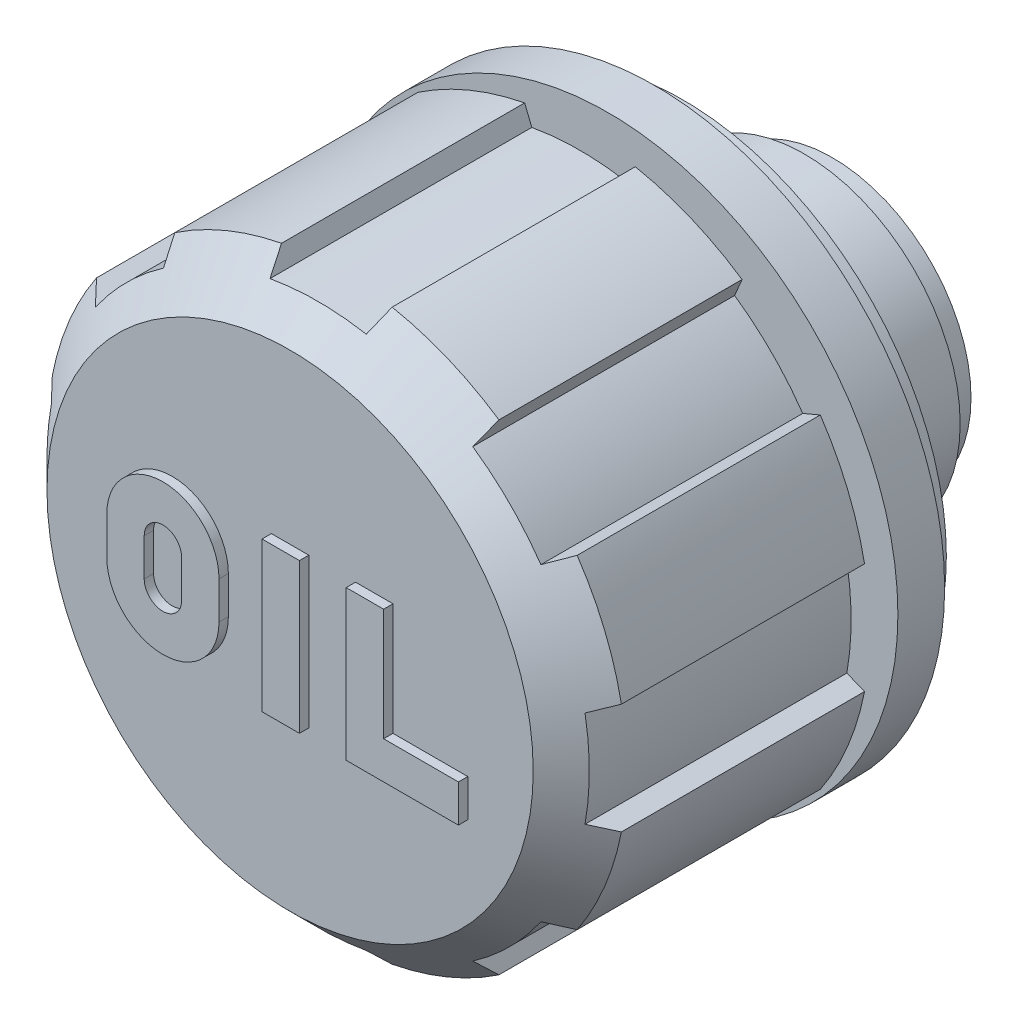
ISO-10303-21;
HEADER;
FILE_DESCRIPTION(('STEP AP214'),'2;1');
FILE_NAME('part.step','',(''),(''),'','','');
FILE_SCHEMA(('AUTOMOTIVE_DESIGN { 1 0 10303 214 1 1 1 1 }'));
ENDSEC;
DATA;
#1=APPLICATION_CONTEXT('core data for automotive mechanical design processes');
#2=APPLICATION_PROTOCOL_DEFINITION('international standard','automotive_design',2000,#1);
#3=PRODUCT_CONTEXT('',#1,'mechanical');
#4=PRODUCT('Part','Part','',(#3));
#5=PRODUCT_RELATED_PRODUCT_CATEGORY('part','',(#4));
#6=PRODUCT_DEFINITION_FORMATION('','',#4);
#7=PRODUCT_DEFINITION_CONTEXT('part definition',#1,'design');
#8=PRODUCT_DEFINITION('design','',#6,#7);
#9=PRODUCT_DEFINITION_SHAPE('','',#8);
#10=(LENGTH_UNIT() NAMED_UNIT(*) SI_UNIT(.MILLI.,.METRE.));
#11=(NAMED_UNIT(*) PLANE_ANGLE_UNIT() SI_UNIT($,.RADIAN.));
#12=(NAMED_UNIT(*) SI_UNIT($,.STERADIAN.) SOLID_ANGLE_UNIT());
#13=UNCERTAINTY_MEASURE_WITH_UNIT(LENGTH_MEASURE(1.E-05),#10,'distance_accuracy_value','');
#14=(GEOMETRIC_REPRESENTATION_CONTEXT(3) GLOBAL_UNCERTAINTY_ASSIGNED_CONTEXT((#13)) GLOBAL_UNIT_ASSIGNED_CONTEXT((#10,
#11,#12)) REPRESENTATION_CONTEXT('',''));
#15=CARTESIAN_POINT('',(0.,0.,0.));
#16=DIRECTION('',(0.,0.,1.));
#17=DIRECTION('',(1.,0.,0.));
#18=AXIS2_PLACEMENT_3D('',#15,#16,#17);
#19=CARTESIAN_POINT('',(0.,0.,21.));
#20=DIRECTION('',(0.,0.,1.));
#21=DIRECTION('',(1.,0.,0.));
#22=AXIS2_PLACEMENT_3D('',#19,#20,#21);
#23=PLANE('',#22);
#24=CARTESIAN_POINT('',(-6.30075,1.00075000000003,21.));
#25=DIRECTION('',(0.,0.,1.));
#26=DIRECTION('',(1.,0.,0.));
#27=AXIS2_PLACEMENT_3D('',#24,#25,#26);
#28=CIRCLE('',#27,1.);
#29=CARTESIAN_POINT('',(-5.30075,1.00075000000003,21.));
#30=VERTEX_POINT('',#29);
#31=CARTESIAN_POINT('',(-7.30075,1.00075000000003,21.));
#32=VERTEX_POINT('',#31);
#33=EDGE_CURVE('E296',#30,#32,#28,.T.);
#34=ORIENTED_EDGE('',*,*,#33,.T.);
#35=DIRECTION('',(0.,1.,0.));
#36=VECTOR('',#35,1.);
#37=CARTESIAN_POINT('',(-7.30075,1.00075000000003,21.));
#38=LINE('',#37,#36);
#39=CARTESIAN_POINT('',(-7.30075,-1.00074999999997,21.));
#40=VERTEX_POINT('',#39);
#41=EDGE_CURVE('E291',#32,#40,#38,.F.);
#42=ORIENTED_EDGE('',*,*,#41,.T.);
#43=CARTESIAN_POINT('',(-6.30075,-1.00074999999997,21.));
#44=DIRECTION('',(0.,0.,1.));
#45=DIRECTION('',(1.,0.,0.));
#46=AXIS2_PLACEMENT_3D('',#43,#44,#45);
#47=CIRCLE('',#46,1.);
#48=CARTESIAN_POINT('',(-5.30075,-1.00074999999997,21.));
#49=VERTEX_POINT('',#48);
#50=EDGE_CURVE('E275',#40,#49,#47,.T.);
#51=ORIENTED_EDGE('',*,*,#50,.T.);
#52=DIRECTION('',(0.,1.,0.));
#53=VECTOR('',#52,1.);
#54=CARTESIAN_POINT('',(-5.30075,-1.00074999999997,21.));
#55=LINE('',#54,#53);
#56=EDGE_CURVE('E301',#49,#30,#55,.T.);
#57=ORIENTED_EDGE('',*,*,#56,.T.);
#58=EDGE_LOOP('',(#34,#42,#51,#57));
#59=FACE_BOUND('',#58,.T.);
#60=ADVANCED_FACE('F14',(#59),#23,.T.);
#61=CARTESIAN_POINT('',(-6.30075,-1.00074999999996,21.5));
#62=DIRECTION('',(0.,0.,1.));
#63=DIRECTION('',(1.,0.,0.));
#64=AXIS2_PLACEMENT_3D('',#61,#62,#63);
#65=CYLINDRICAL_SURFACE('',#64,1.);
#66=DIRECTION('',(0.,0.,1.));
#67=VECTOR('',#66,1.);
#68=CARTESIAN_POINT('',(-7.30075,-1.00074999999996,21.5));
#69=LINE('',#68,#67);
#70=CARTESIAN_POINT('',(-7.30075,-1.00074999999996,21.5));
#71=VERTEX_POINT('',#70);
#72=EDGE_CURVE('E279',#40,#71,#69,.T.);
#73=ORIENTED_EDGE('',*,*,#72,.T.);
#74=CARTESIAN_POINT('',(-6.30075,-1.00074999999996,21.5));
#75=DIRECTION('',(0.,0.,1.));
#76=DIRECTION('',(1.,0.,0.));
#77=AXIS2_PLACEMENT_3D('',#74,#75,#76);
#78=CIRCLE('',#77,1.);
#79=CARTESIAN_POINT('',(-5.30075,-1.00074999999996,21.5));
#80=VERTEX_POINT('',#79);
#81=EDGE_CURVE('E953',#80,#71,#78,.F.);
#82=ORIENTED_EDGE('',*,*,#81,.F.);
#83=DIRECTION('',(0.,0.,-1.));
#84=VECTOR('',#83,1.);
#85=CARTESIAN_POINT('',(-5.30075,-1.00074999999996,21.5));
#86=LINE('',#85,#84);
#87=EDGE_CURVE('E281',#80,#49,#86,.T.);
#88=ORIENTED_EDGE('',*,*,#87,.T.);
#89=ORIENTED_EDGE('',*,*,#50,.F.);
#90=EDGE_LOOP('',(#73,#82,#88,#89));
#91=FACE_BOUND('',#90,.T.);
#92=ADVANCED_FACE('F277',(#91),#65,.F.);
#93=CARTESIAN_POINT('',(-7.30075,1.00075000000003,21.5));
#94=DIRECTION('',(-1.,0.,0.));
#95=DIRECTION('',(0.,0.,1.));
#96=AXIS2_PLACEMENT_3D('',#93,#94,#95);
#97=PLANE('',#96);
#98=DIRECTION('',(0.,0.,1.));
#99=VECTOR('',#98,1.);
#100=CARTESIAN_POINT('',(-7.30075,1.00075000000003,21.5));
#101=LINE('',#100,#99);
#102=CARTESIAN_POINT('',(-7.30075,1.00075000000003,21.5));
#103=VERTEX_POINT('',#102);
#104=EDGE_CURVE('E297',#32,#103,#101,.T.);
#105=ORIENTED_EDGE('',*,*,#104,.T.);
#106=DIRECTION('',(0.,1.,0.));
#107=VECTOR('',#106,1.);
#108=CARTESIAN_POINT('',(-7.30075,0.,21.5));
#109=LINE('',#108,#107);
#110=EDGE_CURVE('E293',#71,#103,#109,.T.);
#111=ORIENTED_EDGE('',*,*,#110,.F.);
#112=ORIENTED_EDGE('',*,*,#72,.F.);
#113=ORIENTED_EDGE('',*,*,#41,.F.);
#114=EDGE_LOOP('',(#105,#111,#112,#113));
#115=FACE_BOUND('',#114,.T.);
#116=ADVANCED_FACE('F290',(#115),#97,.F.);
#117=CARTESIAN_POINT('',(-6.30075,1.00075000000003,21.5));
#118=DIRECTION('',(0.,0.,1.));
#119=DIRECTION('',(1.,0.,0.));
#120=AXIS2_PLACEMENT_3D('',#117,#118,#119);
#121=CYLINDRICAL_SURFACE('',#120,1.);
#122=DIRECTION('',(0.,0.,-1.));
#123=VECTOR('',#122,1.);
#124=CARTESIAN_POINT('',(-5.30075,1.00075000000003,21.5));
#125=LINE('',#124,#123);
#126=CARTESIAN_POINT('',(-5.30075,1.00075000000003,21.5));
#127=VERTEX_POINT('',#126);
#128=EDGE_CURVE('E955',#30,#127,#125,.F.);
#129=ORIENTED_EDGE('',*,*,#128,.T.);
#130=CARTESIAN_POINT('',(-6.30075,1.00075000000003,21.5));
#131=DIRECTION('',(0.,0.,1.));
#132=DIRECTION('',(1.,0.,0.));
#133=AXIS2_PLACEMENT_3D('',#130,#131,#132);
#134=CIRCLE('',#133,1.);
#135=EDGE_CURVE('E951',#103,#127,#134,.F.);
#136=ORIENTED_EDGE('',*,*,#135,.F.);
#137=ORIENTED_EDGE('',*,*,#104,.F.);
#138=ORIENTED_EDGE('',*,*,#33,.F.);
#139=EDGE_LOOP('',(#129,#136,#137,#138));
#140=FACE_BOUND('',#139,.T.);
#141=ADVANCED_FACE('F587',(#140),#121,.F.);
#142=CARTESIAN_POINT('',(-5.30075,-1.00074999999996,21.5));
#143=DIRECTION('',(1.,0.,0.));
#144=DIRECTION('',(0.,0.,-1.));
#145=AXIS2_PLACEMENT_3D('',#142,#143,#144);
#146=PLANE('',#145);
#147=ORIENTED_EDGE('',*,*,#87,.F.);
#148=DIRECTION('',(0.,1.,0.));
#149=VECTOR('',#148,1.);
#150=CARTESIAN_POINT('',(-5.30075,0.,21.5));
#151=LINE('',#150,#149);
#152=EDGE_CURVE('E947',#127,#80,#151,.F.);
#153=ORIENTED_EDGE('',*,*,#152,.F.);
#154=ORIENTED_EDGE('',*,*,#128,.F.);
#155=ORIENTED_EDGE('',*,*,#56,.F.);
#156=EDGE_LOOP('',(#147,#153,#154,#155));
#157=FACE_BOUND('',#156,.T.);
#158=ADVANCED_FACE('F583',(#157),#146,.F.);
#159=CARTESIAN_POINT('',(0.,0.,21.5));
#160=DIRECTION('',(0.,0.,1.));
#161=DIRECTION('',(1.,0.,0.));
#162=AXIS2_PLACEMENT_3D('',#159,#160,#161);
#163=PLANE('',#162);
#164=DIRECTION('',(-1.,0.,0.));
#165=VECTOR('',#164,1.);
#166=CARTESIAN_POINT('',(5.4999,4.,21.5));
#167=LINE('',#166,#165);
#168=CARTESIAN_POINT('',(3.4999,4.,21.5));
#169=VERTEX_POINT('',#168);
#170=CARTESIAN_POINT('',(5.4999,4.,21.5));
#171=VERTEX_POINT('',#170);
#172=EDGE_CURVE('E926',#169,#171,#167,.F.);
#173=ORIENTED_EDGE('',*,*,#172,.F.);
#174=DIRECTION('',(0.,1.,0.));
#175=VECTOR('',#174,1.);
#176=CARTESIAN_POINT('',(3.4999,4.,21.5));
#177=LINE('',#176,#175);
#178=CARTESIAN_POINT('',(3.4999,-4.,21.5));
#179=VERTEX_POINT('',#178);
#180=EDGE_CURVE('E932',#179,#169,#177,.T.);
#181=ORIENTED_EDGE('',*,*,#180,.F.);
#182=DIRECTION('',(1.,0.,0.));
#183=VECTOR('',#182,1.);
#184=CARTESIAN_POINT('',(3.4999,-4.,21.5));
#185=LINE('',#184,#183);
#186=CARTESIAN_POINT('',(9.49990774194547,-4.,21.5));
#187=VERTEX_POINT('',#186);
#188=EDGE_CURVE('E938',#187,#179,#185,.F.);
#189=ORIENTED_EDGE('',*,*,#188,.F.);
#190=DIRECTION('',(0.,1.,0.));
#191=VECTOR('',#190,1.);
#192=CARTESIAN_POINT('',(9.49990774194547,-4.,21.5));
#193=LINE('',#192,#191);
#194=CARTESIAN_POINT('',(9.49990774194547,-1.99999999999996,21.5));
#195=VERTEX_POINT('',#194);
#196=EDGE_CURVE('E944',#195,#187,#193,.F.);
#197=ORIENTED_EDGE('',*,*,#196,.F.);
#198=DIRECTION('',(-1.,0.,0.));
#199=VECTOR('',#198,1.);
#200=CARTESIAN_POINT('',(9.49990774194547,-1.99999999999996,21.5));
#201=LINE('',#200,#199);
#202=CARTESIAN_POINT('',(5.4999,-1.99999999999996,21.5));
#203=VERTEX_POINT('',#202);
#204=EDGE_CURVE('E914',#203,#195,#201,.F.);
#205=ORIENTED_EDGE('',*,*,#204,.F.);
#206=DIRECTION('',(0.,1.,0.));
#207=VECTOR('',#206,1.);
#208=CARTESIAN_POINT('',(5.4999,-1.99999999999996,21.5));
#209=LINE('',#208,#207);
#210=EDGE_CURVE('E920',#171,#203,#209,.F.);
#211=ORIENTED_EDGE('',*,*,#210,.F.);
#212=EDGE_LOOP('',(#173,#181,#189,#197,#205,#211));
#213=FACE_BOUND('',#212,.T.);
#214=ADVANCED_FACE('F579',(#213),#163,.T.);
#215=CARTESIAN_POINT('',(0.,0.,21.5));
#216=DIRECTION('',(0.,0.,1.));
#217=DIRECTION('',(1.,0.,0.));
#218=AXIS2_PLACEMENT_3D('',#215,#216,#217);
#219=PLANE('',#218);
#220=DIRECTION('',(-1.,0.,0.));
#221=VECTOR('',#220,1.);
#222=CARTESIAN_POINT('',(1.,4.,21.5));
#223=LINE('',#222,#221);
#224=CARTESIAN_POINT('',(-1.,4.,21.5));
#225=VERTEX_POINT('',#224);
#226=CARTESIAN_POINT('',(1.,4.,21.5));
#227=VERTEX_POINT('',#226);
#228=EDGE_CURVE('E890',#225,#227,#223,.F.);
#229=ORIENTED_EDGE('',*,*,#228,.F.);
#230=DIRECTION('',(0.,1.,0.));
#231=VECTOR('',#230,1.);
#232=CARTESIAN_POINT('',(-1.,4.,21.5));
#233=LINE('',#232,#231);
#234=CARTESIAN_POINT('',(-1.,-4.,21.5));
#235=VERTEX_POINT('',#234);
#236=EDGE_CURVE('E896',#235,#225,#233,.T.);
#237=ORIENTED_EDGE('',*,*,#236,.F.);
#238=DIRECTION('',(1.,0.,0.));
#239=VECTOR('',#238,1.);
#240=CARTESIAN_POINT('',(-1.,-4.,21.5));
#241=LINE('',#240,#239);
#242=CARTESIAN_POINT('',(1.,-4.,21.5));
#243=VERTEX_POINT('',#242);
#244=EDGE_CURVE('E902',#243,#235,#241,.F.);
#245=ORIENTED_EDGE('',*,*,#244,.F.);
#246=DIRECTION('',(0.,1.,0.));
#247=VECTOR('',#246,1.);
#248=CARTESIAN_POINT('',(1.,-4.,21.5));
#249=LINE('',#248,#247);
#250=EDGE_CURVE('E908',#227,#243,#249,.F.);
#251=ORIENTED_EDGE('',*,*,#250,.F.);
#252=EDGE_LOOP('',(#229,#237,#245,#251));
#253=FACE_BOUND('',#252,.T.);
#254=ADVANCED_FACE('F575',(#253),#219,.T.);
#255=CARTESIAN_POINT('',(0.,0.,21.5));
#256=DIRECTION('',(0.,0.,1.));
#257=DIRECTION('',(1.,0.,0.));
#258=AXIS2_PLACEMENT_3D('',#255,#256,#257);
#259=PLANE('',#258);
#260=DIRECTION('',(0.,1.,0.));
#261=VECTOR('',#260,1.);
#262=CARTESIAN_POINT('',(-3.3015,-1.00074999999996,21.5));
#263=LINE('',#262,#261);
#264=CARTESIAN_POINT('',(-3.3015,1.00075000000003,21.5));
#265=VERTEX_POINT('',#264);
#266=CARTESIAN_POINT('',(-3.3015,-1.00074999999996,21.5));
#267=VERTEX_POINT('',#266);
#268=EDGE_CURVE('E876',#265,#267,#263,.F.);
#269=ORIENTED_EDGE('',*,*,#268,.F.);
#270=CARTESIAN_POINT('',(-6.30075,1.00075000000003,21.5));
#271=DIRECTION('',(0.,0.,1.));
#272=DIRECTION('',(1.,0.,0.));
#273=AXIS2_PLACEMENT_3D('',#270,#271,#272);
#274=CIRCLE('',#273,2.99925);
#275=CARTESIAN_POINT('',(-9.3,1.00075000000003,21.5));
#276=VERTEX_POINT('',#275);
#277=EDGE_CURVE('E877',#276,#265,#274,.F.);
#278=ORIENTED_EDGE('',*,*,#277,.F.);
#279=DIRECTION('',(0.,1.,0.));
#280=VECTOR('',#279,1.);
#281=CARTESIAN_POINT('',(-9.3,1.00075000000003,21.5));
#282=LINE('',#281,#280);
#283=CARTESIAN_POINT('',(-9.3,-1.00074999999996,21.5));
#284=VERTEX_POINT('',#283);
#285=EDGE_CURVE('E882',#284,#276,#282,.T.);
#286=ORIENTED_EDGE('',*,*,#285,.F.);
#287=CARTESIAN_POINT('',(-6.30075,-1.00074999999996,21.5));
#288=DIRECTION('',(0.,0.,1.));
#289=DIRECTION('',(1.,0.,0.));
#290=AXIS2_PLACEMENT_3D('',#287,#288,#289);
#291=CIRCLE('',#290,2.99925);
#292=EDGE_CURVE('E886',#267,#284,#291,.F.);
#293=ORIENTED_EDGE('',*,*,#292,.F.);
#294=EDGE_LOOP('',(#269,#278,#286,#293));
#295=FACE_BOUND('',#294,.T.);
#296=ORIENTED_EDGE('',*,*,#135,.T.);
#297=ORIENTED_EDGE('',*,*,#152,.T.);
#298=ORIENTED_EDGE('',*,*,#81,.T.);
#299=ORIENTED_EDGE('',*,*,#110,.T.);
#300=EDGE_LOOP('',(#296,#297,#298,#299));
#301=FACE_BOUND('',#300,.T.);
#302=ADVANCED_FACE('F571',(#295,#301),#259,.T.);
#303=CARTESIAN_POINT('',(9.49990774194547,-4.,21.5));
#304=DIRECTION('',(1.,0.,0.));
#305=DIRECTION('',(0.,0.,-1.));
#306=AXIS2_PLACEMENT_3D('',#303,#304,#305);
#307=PLANE('',#306);
#308=ORIENTED_EDGE('',*,*,#196,.T.);
#309=DIRECTION('',(0.,0.,1.));
#310=VECTOR('',#309,1.);
#311=CARTESIAN_POINT('',(9.49990774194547,-4.,21.5));
#312=LINE('',#311,#310);
#313=CARTESIAN_POINT('',(9.49990774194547,-4.,21.));
#314=VERTEX_POINT('',#313);
#315=EDGE_CURVE('E941',#314,#187,#312,.T.);
#316=ORIENTED_EDGE('',*,*,#315,.F.);
#317=DIRECTION('',(0.,1.,0.));
#318=VECTOR('',#317,1.);
#319=CARTESIAN_POINT('',(9.49990774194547,6.5,21.));
#320=LINE('',#319,#318);
#321=CARTESIAN_POINT('',(9.49990774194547,-1.99999999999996,21.));
#322=VERTEX_POINT('',#321);
#323=EDGE_CURVE('E869',#322,#314,#320,.F.);
#324=ORIENTED_EDGE('',*,*,#323,.F.);
#325=DIRECTION('',(0.,0.,1.));
#326=VECTOR('',#325,1.);
#327=CARTESIAN_POINT('',(9.49990774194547,-1.99999999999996,21.5));
#328=LINE('',#327,#326);
#329=EDGE_CURVE('E911',#195,#322,#328,.F.);
#330=ORIENTED_EDGE('',*,*,#329,.F.);
#331=EDGE_LOOP('',(#308,#316,#324,#330));
#332=FACE_BOUND('',#331,.T.);
#333=ADVANCED_FACE('F567',(#332),#307,.T.);
#334=CARTESIAN_POINT('',(3.4999,-4.,21.5));
#335=DIRECTION('',(0.,-1.,0.));
#336=DIRECTION('',(1.,0.,0.));
#337=AXIS2_PLACEMENT_3D('',#334,#335,#336);
#338=PLANE('',#337);
#339=ORIENTED_EDGE('',*,*,#188,.T.);
#340=DIRECTION('',(0.,0.,1.));
#341=VECTOR('',#340,1.);
#342=CARTESIAN_POINT('',(3.4999,-4.,21.5));
#343=LINE('',#342,#341);
#344=CARTESIAN_POINT('',(3.4999,-4.,21.));
#345=VERTEX_POINT('',#344);
#346=EDGE_CURVE('E935',#345,#179,#343,.T.);
#347=ORIENTED_EDGE('',*,*,#346,.F.);
#348=DIRECTION('',(1.,0.,0.));
#349=VECTOR('',#348,1.);
#350=CARTESIAN_POINT('',(0.,-4.,21.));
#351=LINE('',#350,#349);
#352=EDGE_CURVE('E866',#314,#345,#351,.F.);
#353=ORIENTED_EDGE('',*,*,#352,.F.);
#354=ORIENTED_EDGE('',*,*,#315,.T.);
#355=EDGE_LOOP('',(#339,#347,#353,#354));
#356=FACE_BOUND('',#355,.T.);
#357=ADVANCED_FACE('F563',(#356),#338,.T.);
#358=CARTESIAN_POINT('',(3.4999,4.,21.5));
#359=DIRECTION('',(-1.,0.,0.));
#360=DIRECTION('',(0.,0.,1.));
#361=AXIS2_PLACEMENT_3D('',#358,#359,#360);
#362=PLANE('',#361);
#363=ORIENTED_EDGE('',*,*,#180,.T.);
#364=DIRECTION('',(0.,0.,1.));
#365=VECTOR('',#364,1.);
#366=CARTESIAN_POINT('',(3.4999,4.,21.5));
#367=LINE('',#366,#365);
#368=CARTESIAN_POINT('',(3.4999,4.,21.));
#369=VERTEX_POINT('',#368);
#370=EDGE_CURVE('E929',#369,#169,#367,.T.);
#371=ORIENTED_EDGE('',*,*,#370,.F.);
#372=DIRECTION('',(0.,1.,0.));
#373=VECTOR('',#372,1.);
#374=CARTESIAN_POINT('',(3.4999,6.5,21.));
#375=LINE('',#374,#373);
#376=EDGE_CURVE('E863',#345,#369,#375,.T.);
#377=ORIENTED_EDGE('',*,*,#376,.F.);
#378=ORIENTED_EDGE('',*,*,#346,.T.);
#379=EDGE_LOOP('',(#363,#371,#377,#378));
#380=FACE_BOUND('',#379,.T.);
#381=ADVANCED_FACE('F559',(#380),#362,.T.);
#382=CARTESIAN_POINT('',(5.4999,4.,21.5));
#383=DIRECTION('',(0.,1.,0.));
#384=DIRECTION('',(-1.,0.,0.));
#385=AXIS2_PLACEMENT_3D('',#382,#383,#384);
#386=PLANE('',#385);
#387=ORIENTED_EDGE('',*,*,#172,.T.);
#388=DIRECTION('',(0.,0.,-1.));
#389=VECTOR('',#388,1.);
#390=CARTESIAN_POINT('',(5.4999,4.,21.5));
#391=LINE('',#390,#389);
#392=CARTESIAN_POINT('',(5.4999,4.,21.));
#393=VERTEX_POINT('',#392);
#394=EDGE_CURVE('E923',#393,#171,#391,.F.);
#395=ORIENTED_EDGE('',*,*,#394,.F.);
#396=DIRECTION('',(1.,0.,0.));
#397=VECTOR('',#396,1.);
#398=CARTESIAN_POINT('',(0.,4.,21.));
#399=LINE('',#398,#397);
#400=EDGE_CURVE('E860',#369,#393,#399,.T.);
#401=ORIENTED_EDGE('',*,*,#400,.F.);
#402=ORIENTED_EDGE('',*,*,#370,.T.);
#403=EDGE_LOOP('',(#387,#395,#401,#402));
#404=FACE_BOUND('',#403,.T.);
#405=ADVANCED_FACE('F555',(#404),#386,.T.);
#406=CARTESIAN_POINT('',(5.4999,-1.99999999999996,21.5));
#407=DIRECTION('',(1.,0.,0.));
#408=DIRECTION('',(0.,0.,-1.));
#409=AXIS2_PLACEMENT_3D('',#406,#407,#408);
#410=PLANE('',#409);
#411=ORIENTED_EDGE('',*,*,#210,.T.);
#412=DIRECTION('',(0.,0.,1.));
#413=VECTOR('',#412,1.);
#414=CARTESIAN_POINT('',(5.4999,-1.99999999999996,21.5));
#415=LINE('',#414,#413);
#416=CARTESIAN_POINT('',(5.4999,-1.99999999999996,21.));
#417=VERTEX_POINT('',#416);
#418=EDGE_CURVE('E917',#417,#203,#415,.T.);
#419=ORIENTED_EDGE('',*,*,#418,.F.);
#420=DIRECTION('',(0.,1.,0.));
#421=VECTOR('',#420,1.);
#422=CARTESIAN_POINT('',(5.4999,6.5,21.));
#423=LINE('',#422,#421);
#424=EDGE_CURVE('E857',#393,#417,#423,.F.);
#425=ORIENTED_EDGE('',*,*,#424,.F.);
#426=ORIENTED_EDGE('',*,*,#394,.T.);
#427=EDGE_LOOP('',(#411,#419,#425,#426));
#428=FACE_BOUND('',#427,.T.);
#429=ADVANCED_FACE('F551',(#428),#410,.T.);
#430=CARTESIAN_POINT('',(9.49990774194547,-1.99999999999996,21.5));
#431=DIRECTION('',(0.,1.,0.));
#432=DIRECTION('',(-1.,0.,0.));
#433=AXIS2_PLACEMENT_3D('',#430,#431,#432);
#434=PLANE('',#433);
#435=ORIENTED_EDGE('',*,*,#204,.T.);
#436=ORIENTED_EDGE('',*,*,#329,.T.);
#437=DIRECTION('',(1.,0.,0.));
#438=VECTOR('',#437,1.);
#439=CARTESIAN_POINT('',(0.,-1.99999999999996,21.));
#440=LINE('',#439,#438);
#441=EDGE_CURVE('E854',#417,#322,#440,.T.);
#442=ORIENTED_EDGE('',*,*,#441,.F.);
#443=ORIENTED_EDGE('',*,*,#418,.T.);
#444=EDGE_LOOP('',(#435,#436,#442,#443));
#445=FACE_BOUND('',#444,.T.);
#446=ADVANCED_FACE('F547',(#445),#434,.T.);
#447=CARTESIAN_POINT('',(1.,-4.,21.5));
#448=DIRECTION('',(1.,0.,0.));
#449=DIRECTION('',(0.,0.,-1.));
#450=AXIS2_PLACEMENT_3D('',#447,#448,#449);
#451=PLANE('',#450);
#452=ORIENTED_EDGE('',*,*,#250,.T.);
#453=DIRECTION('',(0.,0.,1.));
#454=VECTOR('',#453,1.);
#455=CARTESIAN_POINT('',(1.,-4.,21.5));
#456=LINE('',#455,#454);
#457=CARTESIAN_POINT('',(1.,-4.,21.));
#458=VERTEX_POINT('',#457);
#459=EDGE_CURVE('E905',#458,#243,#456,.T.);
#460=ORIENTED_EDGE('',*,*,#459,.F.);
#461=DIRECTION('',(0.,1.,0.));
#462=VECTOR('',#461,1.);
#463=CARTESIAN_POINT('',(1.,6.5,21.));
#464=LINE('',#463,#462);
#465=CARTESIAN_POINT('',(1.,4.,21.));
#466=VERTEX_POINT('',#465);
#467=EDGE_CURVE('E851',#466,#458,#464,.F.);
#468=ORIENTED_EDGE('',*,*,#467,.F.);
#469=DIRECTION('',(0.,0.,1.));
#470=VECTOR('',#469,1.);
#471=CARTESIAN_POINT('',(1.,4.,21.5));
#472=LINE('',#471,#470);
#473=EDGE_CURVE('E887',#227,#466,#472,.F.);
#474=ORIENTED_EDGE('',*,*,#473,.F.);
#475=EDGE_LOOP('',(#452,#460,#468,#474));
#476=FACE_BOUND('',#475,.T.);
#477=ADVANCED_FACE('F543',(#476),#451,.T.);
#478=CARTESIAN_POINT('',(-1.,-4.,21.5));
#479=DIRECTION('',(0.,-1.,0.));
#480=DIRECTION('',(1.,0.,0.));
#481=AXIS2_PLACEMENT_3D('',#478,#479,#480);
#482=PLANE('',#481);
#483=ORIENTED_EDGE('',*,*,#244,.T.);
#484=DIRECTION('',(0.,0.,1.));
#485=VECTOR('',#484,1.);
#486=CARTESIAN_POINT('',(-1.,-4.,21.5));
#487=LINE('',#486,#485);
#488=CARTESIAN_POINT('',(-1.,-4.,21.));
#489=VERTEX_POINT('',#488);
#490=EDGE_CURVE('E899',#489,#235,#487,.T.);
#491=ORIENTED_EDGE('',*,*,#490,.F.);
#492=DIRECTION('',(1.,0.,0.));
#493=VECTOR('',#492,1.);
#494=CARTESIAN_POINT('',(0.,-4.,21.));
#495=LINE('',#494,#493);
#496=EDGE_CURVE('E848',#458,#489,#495,.F.);
#497=ORIENTED_EDGE('',*,*,#496,.F.);
#498=ORIENTED_EDGE('',*,*,#459,.T.);
#499=EDGE_LOOP('',(#483,#491,#497,#498));
#500=FACE_BOUND('',#499,.T.);
#501=ADVANCED_FACE('F539',(#500),#482,.T.);
#502=CARTESIAN_POINT('',(-1.,4.,21.5));
#503=DIRECTION('',(-1.,0.,0.));
#504=DIRECTION('',(0.,0.,1.));
#505=AXIS2_PLACEMENT_3D('',#502,#503,#504);
#506=PLANE('',#505);
#507=ORIENTED_EDGE('',*,*,#236,.T.);
#508=DIRECTION('',(0.,0.,1.));
#509=VECTOR('',#508,1.);
#510=CARTESIAN_POINT('',(-1.,4.,21.5));
#511=LINE('',#510,#509);
#512=CARTESIAN_POINT('',(-1.,4.,21.));
#513=VERTEX_POINT('',#512);
#514=EDGE_CURVE('E893',#513,#225,#511,.T.);
#515=ORIENTED_EDGE('',*,*,#514,.F.);
#516=DIRECTION('',(0.,1.,0.));
#517=VECTOR('',#516,1.);
#518=CARTESIAN_POINT('',(-1.,6.5,21.));
#519=LINE('',#518,#517);
#520=EDGE_CURVE('E845',#489,#513,#519,.T.);
#521=ORIENTED_EDGE('',*,*,#520,.F.);
#522=ORIENTED_EDGE('',*,*,#490,.T.);
#523=EDGE_LOOP('',(#507,#515,#521,#522));
#524=FACE_BOUND('',#523,.T.);
#525=ADVANCED_FACE('F535',(#524),#506,.T.);
#526=CARTESIAN_POINT('',(1.,4.,21.5));
#527=DIRECTION('',(0.,1.,0.));
#528=DIRECTION('',(-1.,0.,0.));
#529=AXIS2_PLACEMENT_3D('',#526,#527,#528);
#530=PLANE('',#529);
#531=ORIENTED_EDGE('',*,*,#228,.T.);
#532=ORIENTED_EDGE('',*,*,#473,.T.);
#533=DIRECTION('',(1.,0.,0.));
#534=VECTOR('',#533,1.);
#535=CARTESIAN_POINT('',(0.,4.,21.));
#536=LINE('',#535,#534);
#537=EDGE_CURVE('E842',#513,#466,#536,.T.);
#538=ORIENTED_EDGE('',*,*,#537,.F.);
#539=ORIENTED_EDGE('',*,*,#514,.T.);
#540=EDGE_LOOP('',(#531,#532,#538,#539));
#541=FACE_BOUND('',#540,.T.);
#542=ADVANCED_FACE('F531',(#541),#530,.T.);
#543=CARTESIAN_POINT('',(-6.30075,-1.00074999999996,21.5));
#544=DIRECTION('',(0.,0.,1.));
#545=DIRECTION('',(1.,0.,0.));
#546=AXIS2_PLACEMENT_3D('',#543,#544,#545);
#547=CYLINDRICAL_SURFACE('',#546,2.99925);
#548=ORIENTED_EDGE('',*,*,#292,.T.);
#549=DIRECTION('',(0.,0.,1.));
#550=VECTOR('',#549,1.);
#551=CARTESIAN_POINT('',(-9.3,-1.00074999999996,21.5));
#552=LINE('',#551,#550);
#553=CARTESIAN_POINT('',(-9.3,-1.00074999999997,21.));
#554=VERTEX_POINT('',#553);
#555=EDGE_CURVE('E883',#554,#284,#552,.T.);
#556=ORIENTED_EDGE('',*,*,#555,.F.);
#557=CARTESIAN_POINT('',(-6.30075,-1.00074999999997,21.));
#558=DIRECTION('',(0.,0.,1.));
#559=DIRECTION('',(1.,0.,0.));
#560=AXIS2_PLACEMENT_3D('',#557,#558,#559);
#561=CIRCLE('',#560,2.99925);
#562=CARTESIAN_POINT('',(-3.3015,-1.00074999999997,21.));
#563=VERTEX_POINT('',#562);
#564=EDGE_CURVE('E841',#563,#554,#561,.F.);
#565=ORIENTED_EDGE('',*,*,#564,.F.);
#566=DIRECTION('',(0.,0.,-1.));
#567=VECTOR('',#566,1.);
#568=CARTESIAN_POINT('',(-3.3015,-1.00074999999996,21.5));
#569=LINE('',#568,#567);
#570=EDGE_CURVE('E872',#267,#563,#569,.T.);
#571=ORIENTED_EDGE('',*,*,#570,.F.);
#572=EDGE_LOOP('',(#548,#556,#565,#571));
#573=FACE_BOUND('',#572,.T.);
#574=ADVANCED_FACE('F527',(#573),#547,.T.);
#575=CARTESIAN_POINT('',(-9.3,1.00075000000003,21.5));
#576=DIRECTION('',(-1.,0.,0.));
#577=DIRECTION('',(0.,0.,1.));
#578=AXIS2_PLACEMENT_3D('',#575,#576,#577);
#579=PLANE('',#578);
#580=ORIENTED_EDGE('',*,*,#285,.T.);
#581=DIRECTION('',(0.,0.,1.));
#582=VECTOR('',#581,1.);
#583=CARTESIAN_POINT('',(-9.3,1.00075000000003,21.5));
#584=LINE('',#583,#582);
#585=CARTESIAN_POINT('',(-9.3,1.00075000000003,21.));
#586=VERTEX_POINT('',#585);
#587=EDGE_CURVE('E879',#586,#276,#584,.T.);
#588=ORIENTED_EDGE('',*,*,#587,.F.);
#589=DIRECTION('',(0.,1.,0.));
#590=VECTOR('',#589,1.);
#591=CARTESIAN_POINT('',(-9.3,6.5,21.));
#592=LINE('',#591,#590);
#593=EDGE_CURVE('E839',#554,#586,#592,.T.);
#594=ORIENTED_EDGE('',*,*,#593,.F.);
#595=ORIENTED_EDGE('',*,*,#555,.T.);
#596=EDGE_LOOP('',(#580,#588,#594,#595));
#597=FACE_BOUND('',#596,.T.);
#598=ADVANCED_FACE('F523',(#597),#579,.T.);
#599=CARTESIAN_POINT('',(-6.30075,1.00075000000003,21.5));
#600=DIRECTION('',(0.,0.,1.));
#601=DIRECTION('',(1.,0.,0.));
#602=AXIS2_PLACEMENT_3D('',#599,#600,#601);
#603=CYLINDRICAL_SURFACE('',#602,2.99925);
#604=ORIENTED_EDGE('',*,*,#277,.T.);
#605=DIRECTION('',(0.,0.,-1.));
#606=VECTOR('',#605,1.);
#607=CARTESIAN_POINT('',(-3.3015,1.00075000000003,21.5));
#608=LINE('',#607,#606);
#609=CARTESIAN_POINT('',(-3.3015,1.00075000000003,21.));
#610=VERTEX_POINT('',#609);
#611=EDGE_CURVE('E873',#610,#265,#608,.F.);
#612=ORIENTED_EDGE('',*,*,#611,.F.);
#613=CARTESIAN_POINT('',(-6.30075,1.00075000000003,21.));
#614=DIRECTION('',(0.,0.,1.));
#615=DIRECTION('',(1.,0.,0.));
#616=AXIS2_PLACEMENT_3D('',#613,#614,#615);
#617=CIRCLE('',#616,2.99925);
#618=EDGE_CURVE('E838',#586,#610,#617,.F.);
#619=ORIENTED_EDGE('',*,*,#618,.F.);
#620=ORIENTED_EDGE('',*,*,#587,.T.);
#621=EDGE_LOOP('',(#604,#612,#619,#620));
#622=FACE_BOUND('',#621,.T.);
#623=ADVANCED_FACE('F519',(#622),#603,.T.);
#624=CARTESIAN_POINT('',(-3.3015,-1.00074999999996,21.5));
#625=DIRECTION('',(1.,0.,0.));
#626=DIRECTION('',(0.,0.,-1.));
#627=AXIS2_PLACEMENT_3D('',#624,#625,#626);
#628=PLANE('',#627);
#629=ORIENTED_EDGE('',*,*,#268,.T.);
#630=ORIENTED_EDGE('',*,*,#570,.T.);
#631=DIRECTION('',(0.,1.,0.));
#632=VECTOR('',#631,1.);
#633=CARTESIAN_POINT('',(-3.3015,6.5,21.));
#634=LINE('',#633,#632);
#635=EDGE_CURVE('E833',#610,#563,#634,.F.);
#636=ORIENTED_EDGE('',*,*,#635,.F.);
#637=ORIENTED_EDGE('',*,*,#611,.T.);
#638=EDGE_LOOP('',(#629,#630,#636,#637));
#639=FACE_BOUND('',#638,.T.);
#640=ADVANCED_FACE('F515',(#639),#628,.T.);
#641=CARTESIAN_POINT('',(0.,6.5,21.));
#642=DIRECTION('',(0.,0.,1.));
#643=DIRECTION('',(1.,0.,0.));
#644=AXIS2_PLACEMENT_3D('',#641,#642,#643);
#645=PLANE('',#644);
#646=CARTESIAN_POINT('',(0.,0.,21.));
#647=DIRECTION('',(0.,0.,-1.));
#648=DIRECTION('',(-1.,0.,0.));
#649=AXIS2_PLACEMENT_3D('',#646,#647,#648);
#650=CIRCLE('',#649,13.);
#651=CARTESIAN_POINT('',(-13.,0.,21.));
#652=VERTEX_POINT('',#651);
#653=EDGE_CURVE('E734',#652,#652,#650,.T.);
#654=ORIENTED_EDGE('',*,*,#653,.F.);
#655=EDGE_LOOP('',(#654));
#656=FACE_BOUND('',#655,.T.);
#657=ORIENTED_EDGE('',*,*,#618,.T.);
#658=ORIENTED_EDGE('',*,*,#635,.T.);
#659=ORIENTED_EDGE('',*,*,#564,.T.);
#660=ORIENTED_EDGE('',*,*,#593,.T.);
#661=EDGE_LOOP('',(#657,#658,#659,#660));
#662=FACE_BOUND('',#661,.T.);
#663=ORIENTED_EDGE('',*,*,#520,.T.);
#664=ORIENTED_EDGE('',*,*,#537,.T.);
#665=ORIENTED_EDGE('',*,*,#467,.T.);
#666=ORIENTED_EDGE('',*,*,#496,.T.);
#667=EDGE_LOOP('',(#663,#664,#665,#666));
#668=FACE_BOUND('',#667,.T.);
#669=ORIENTED_EDGE('',*,*,#424,.T.);
#670=ORIENTED_EDGE('',*,*,#441,.T.);
#671=ORIENTED_EDGE('',*,*,#323,.T.);
#672=ORIENTED_EDGE('',*,*,#352,.T.);
#673=ORIENTED_EDGE('',*,*,#376,.T.);
#674=ORIENTED_EDGE('',*,*,#400,.T.);
#675=EDGE_LOOP('',(#669,#670,#671,#672,#673,#674));
#676=FACE_BOUND('',#675,.T.);
#677=ADVANCED_FACE('F511',(#656,#662,#668,#676),#645,.T.);
#678=CARTESIAN_POINT('',(-8.26892569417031,11.9111237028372,21.5));
#679=DIRECTION('',(0.92050485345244,0.390731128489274,0.));
#680=DIRECTION('',(-0.390731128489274,0.92050485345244,0.));
#681=AXIS2_PLACEMENT_3D('',#678,#679,#680);
#682=PLANE('',#681);
#683=DIRECTION('',(0.,0.,1.));
#684=VECTOR('',#683,1.);
#685=CARTESIAN_POINT('',(-8.66749000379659,12.8500823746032,21.5));
#686=LINE('',#685,#684);
#687=CARTESIAN_POINT('',(-8.66749000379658,12.8500823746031,5.5));
#688=VERTEX_POINT('',#687);
#689=CARTESIAN_POINT('',(-8.66749000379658,12.8500823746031,18.5));
#690=VERTEX_POINT('',#689);
#691=EDGE_CURVE('E1101',#688,#690,#686,.T.);
#692=ORIENTED_EDGE('',*,*,#691,.F.);
#693=DIRECTION('',(-0.390731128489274,0.92050485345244,0.));
#694=VECTOR('',#693,1.);
#695=CARTESIAN_POINT('',(-8.26892569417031,11.9111237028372,5.5));
#696=LINE('',#695,#694);
#697=CARTESIAN_POINT('',(-8.26892569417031,11.9111237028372,5.5));
#698=VERTEX_POINT('',#697);
#699=EDGE_CURVE('E727',#698,#688,#696,.T.);
#700=ORIENTED_EDGE('',*,*,#699,.F.);
#701=DIRECTION('',(0.,0.,1.));
#702=VECTOR('',#701,1.);
#703=CARTESIAN_POINT('',(-8.26892569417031,11.9111237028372,21.5));
#704=LINE('',#703,#702);
#705=CARTESIAN_POINT('',(-8.26892569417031,11.9111237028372,19.5));
#706=VERTEX_POINT('',#705);
#707=EDGE_CURVE('E726',#706,#698,#704,.F.);
#708=ORIENTED_EDGE('',*,*,#707,.F.);
#709=CARTESIAN_POINT('',(-8.66749000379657,12.8500823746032,18.5));
#710=CARTESIAN_POINT('',(-8.60110656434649,12.6936927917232,18.6667813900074));
#711=CARTESIAN_POINT('',(-8.53470115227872,12.5372514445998,18.8335054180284));
#712=CARTESIAN_POINT('',(-8.40184638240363,12.2242652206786,19.1668387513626));
#713=CARTESIAN_POINT('',(-8.33539702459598,12.06772034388,19.3334480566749));
#714=CARTESIAN_POINT('',(-8.26892569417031,11.9111237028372,19.5));
#715=B_SPLINE_CURVE_WITH_KNOTS('',3,(#709,#710,#711,#712,#713,#714),.UNSPECIFIED.,.F.,.F.,(4,2,
4),(0.,0.714229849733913,1.42845970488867),.UNSPECIFIED.);
#716=EDGE_CURVE('E380',#690,#706,#715,.T.);
#717=ORIENTED_EDGE('',*,*,#716,.F.);
#718=EDGE_LOOP('',(#692,#700,#708,#717));
#719=FACE_BOUND('',#718,.T.);
#720=ADVANCED_FACE('F505',(#719),#682,.F.);
#721=CARTESIAN_POINT('',(-2.95753942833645,15.2152213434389,21.5));
#722=DIRECTION('',(-0.927183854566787,-0.374606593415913,0.));
#723=DIRECTION('',(0.374606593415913,-0.927183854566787,0.));
#724=AXIS2_PLACEMENT_3D('',#721,#722,#723);
#725=PLANE('',#724);
#726=DIRECTION('',(0.,0.,1.));
#727=VECTOR('',#726,1.);
#728=CARTESIAN_POINT('',(-2.5754229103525,14.2694497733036,21.5));
#729=LINE('',#728,#727);
#730=CARTESIAN_POINT('',(-2.5754229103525,14.2694497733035,5.5));
#731=VERTEX_POINT('',#730);
#732=CARTESIAN_POINT('',(-2.5754229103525,14.2694497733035,19.5));
#733=VERTEX_POINT('',#732);
#734=EDGE_CURVE('E830',#731,#733,#729,.T.);
#735=ORIENTED_EDGE('',*,*,#734,.F.);
#736=DIRECTION('',(0.374606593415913,-0.927183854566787,0.));
#737=VECTOR('',#736,1.);
#738=CARTESIAN_POINT('',(-2.95753942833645,15.2152213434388,5.5));
#739=LINE('',#738,#737);
#740=CARTESIAN_POINT('',(-2.95753942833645,15.2152213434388,5.5));
#741=VERTEX_POINT('',#740);
#742=EDGE_CURVE('E822',#741,#731,#739,.T.);
#743=ORIENTED_EDGE('',*,*,#742,.F.);
#744=DIRECTION('',(0.,0.,1.));
#745=VECTOR('',#744,1.);
#746=CARTESIAN_POINT('',(-2.95753942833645,15.2152213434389,21.5));
#747=LINE('',#746,#745);
#748=CARTESIAN_POINT('',(-2.95753942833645,15.2152213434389,18.5));
#749=VERTEX_POINT('',#748);
#750=EDGE_CURVE('E739',#749,#741,#747,.F.);
#751=ORIENTED_EDGE('',*,*,#750,.F.);
#752=CARTESIAN_POINT('',(-2.57542291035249,14.2694497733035,19.5));
#753=CARTESIAN_POINT('',(-2.63915112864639,14.4271826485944,19.3334480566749));
#754=CARTESIAN_POINT('',(-2.70285828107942,14.58486338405,19.1668387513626));
#755=CARTESIAN_POINT('',(-2.83023045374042,14.9001205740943,18.8335054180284));
#756=CARTESIAN_POINT('',(-2.8938954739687,15.0576970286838,18.6667813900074));
#757=CARTESIAN_POINT('',(-2.95753942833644,15.2152213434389,18.5));
#758=B_SPLINE_CURVE_WITH_KNOTS('',3,(#752,#753,#754,#755,#756,#757),.UNSPECIFIED.,.F.,.F.,(4,2,
4),(0.,0.714229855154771,1.4284597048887),.UNSPECIFIED.);
#759=EDGE_CURVE('E486',#733,#749,#758,.T.);
#760=ORIENTED_EDGE('',*,*,#759,.F.);
#761=EDGE_LOOP('',(#735,#743,#751,#760));
#762=FACE_BOUND('',#761,.T.);
#763=ADVANCED_FACE('F501',(#762),#725,.F.);
#764=CARTESIAN_POINT('',(2.5754229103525,14.2694497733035,21.5));
#765=DIRECTION('',(0.927183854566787,-0.374606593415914,0.));
#766=DIRECTION('',(0.374606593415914,0.927183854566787,0.));
#767=AXIS2_PLACEMENT_3D('',#764,#765,#766);
#768=PLANE('',#767);
#769=DIRECTION('',(0.,0.,1.));
#770=VECTOR('',#769,1.);
#771=CARTESIAN_POINT('',(2.95753942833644,15.2152213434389,21.5));
#772=LINE('',#771,#770);
#773=CARTESIAN_POINT('',(2.95753942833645,15.2152213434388,5.5));
#774=VERTEX_POINT('',#773);
#775=CARTESIAN_POINT('',(2.95753942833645,15.2152213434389,18.5));
#776=VERTEX_POINT('',#775);
#777=EDGE_CURVE('E820',#774,#776,#772,.T.);
#778=ORIENTED_EDGE('',*,*,#777,.F.);
#779=DIRECTION('',(0.374606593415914,0.927183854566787,0.));
#780=VECTOR('',#779,1.);
#781=CARTESIAN_POINT('',(2.5754229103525,14.2694497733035,5.5));
#782=LINE('',#781,#780);
#783=CARTESIAN_POINT('',(2.5754229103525,14.2694497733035,5.5));
#784=VERTEX_POINT('',#783);
#785=EDGE_CURVE('E815',#784,#774,#782,.T.);
#786=ORIENTED_EDGE('',*,*,#785,.F.);
#787=DIRECTION('',(0.,0.,1.));
#788=VECTOR('',#787,1.);
#789=CARTESIAN_POINT('',(2.5754229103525,14.2694497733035,21.5));
#790=LINE('',#789,#788);
#791=CARTESIAN_POINT('',(2.5754229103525,14.2694497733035,19.5));
#792=VERTEX_POINT('',#791);
#793=EDGE_CURVE('E1103',#792,#784,#790,.F.);
#794=ORIENTED_EDGE('',*,*,#793,.F.);
#795=CARTESIAN_POINT('',(2.95753942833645,15.2152213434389,18.5));
#796=CARTESIAN_POINT('',(2.89389547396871,15.0576970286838,18.6667813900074));
#797=CARTESIAN_POINT('',(2.83023045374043,14.9001205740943,18.8335054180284));
#798=CARTESIAN_POINT('',(2.70285828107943,14.58486338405,19.1668387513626));
#799=CARTESIAN_POINT('',(2.63915112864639,14.4271826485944,19.3334480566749));
#800=CARTESIAN_POINT('',(2.5754229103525,14.2694497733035,19.5));
#801=B_SPLINE_CURVE_WITH_KNOTS('',3,(#795,#796,#797,#798,#799,#800),.UNSPECIFIED.,.F.,.F.,(4,2,
4),(0.,0.714229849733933,1.4284597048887),.UNSPECIFIED.);
#802=EDGE_CURVE('E391',#776,#792,#801,.T.);
#803=ORIENTED_EDGE('',*,*,#802,.F.);
#804=EDGE_LOOP('',(#778,#786,#794,#803));
#805=FACE_BOUND('',#804,.T.);
#806=ADVANCED_FACE('F504',(#805),#768,.F.);
#807=CARTESIAN_POINT('',(8.66749000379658,12.8500823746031,21.5));
#808=DIRECTION('',(-0.92050485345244,0.390731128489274,0.));
#809=DIRECTION('',(-0.390731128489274,-0.92050485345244,0.));
#810=AXIS2_PLACEMENT_3D('',#807,#808,#809);
#811=PLANE('',#810);
#812=DIRECTION('',(0.,0.,1.));
#813=VECTOR('',#812,1.);
#814=CARTESIAN_POINT('',(8.26892569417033,11.9111237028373,21.5));
#815=LINE('',#814,#813);
#816=CARTESIAN_POINT('',(8.26892569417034,11.9111237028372,5.5));
#817=VERTEX_POINT('',#816);
#818=CARTESIAN_POINT('',(8.26892569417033,11.9111237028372,19.5));
#819=VERTEX_POINT('',#818);
#820=EDGE_CURVE('E813',#817,#819,#815,.T.);
#821=ORIENTED_EDGE('',*,*,#820,.F.);
#822=DIRECTION('',(-0.390731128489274,-0.92050485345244,0.));
#823=VECTOR('',#822,1.);
#824=CARTESIAN_POINT('',(8.66749000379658,12.8500823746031,5.5));
#825=LINE('',#824,#823);
#826=CARTESIAN_POINT('',(8.6674900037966,12.8500823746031,5.5));
#827=VERTEX_POINT('',#826);
#828=EDGE_CURVE('E808',#827,#817,#825,.T.);
#829=ORIENTED_EDGE('',*,*,#828,.F.);
#830=DIRECTION('',(0.,0.,1.));
#831=VECTOR('',#830,1.);
#832=CARTESIAN_POINT('',(8.6674900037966,12.8500823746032,21.5));
#833=LINE('',#832,#831);
#834=CARTESIAN_POINT('',(8.6674900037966,12.8500823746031,18.5));
#835=VERTEX_POINT('',#834);
#836=EDGE_CURVE('E826',#835,#827,#833,.F.);
#837=ORIENTED_EDGE('',*,*,#836,.F.);
#838=CARTESIAN_POINT('',(8.26892569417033,11.9111237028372,19.5));
#839=CARTESIAN_POINT('',(8.335397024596,12.06772034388,19.3334480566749));
#840=CARTESIAN_POINT('',(8.40184638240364,12.2242652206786,19.1668387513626));
#841=CARTESIAN_POINT('',(8.53470115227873,12.5372514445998,18.8335054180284));
#842=CARTESIAN_POINT('',(8.6011065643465,12.6936927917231,18.6667813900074));
#843=CARTESIAN_POINT('',(8.66749000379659,12.8500823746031,18.5));
#844=B_SPLINE_CURVE_WITH_KNOTS('',3,(#838,#839,#840,#841,#842,#843),.UNSPECIFIED.,.F.,.F.,(4,2,
4),(0.,0.714229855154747,1.42845970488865),.UNSPECIFIED.);
#845=EDGE_CURVE('E399',#819,#835,#844,.T.);
#846=ORIENTED_EDGE('',*,*,#845,.F.);
#847=EDGE_LOOP('',(#821,#829,#837,#846));
#848=FACE_BOUND('',#847,.T.);
#849=ADVANCED_FACE('F1209',(#848),#811,.F.);
#850=CARTESIAN_POINT('',(11.9111237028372,8.26892569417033,21.5));
#851=DIRECTION('',(0.390731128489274,-0.92050485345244,0.));
#852=DIRECTION('',(0.92050485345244,0.390731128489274,0.));
#853=AXIS2_PLACEMENT_3D('',#850,#851,#852);
#854=PLANE('',#853);
#855=DIRECTION('',(0.,0.,1.));
#856=VECTOR('',#855,1.);
#857=CARTESIAN_POINT('',(12.8500823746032,8.6674900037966,21.5));
#858=LINE('',#857,#856);
#859=CARTESIAN_POINT('',(12.8500823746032,8.66749000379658,5.5));
#860=VERTEX_POINT('',#859);
#861=CARTESIAN_POINT('',(12.8500823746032,8.6674900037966,18.5));
#862=VERTEX_POINT('',#861);
#863=EDGE_CURVE('E806',#860,#862,#858,.T.);
#864=ORIENTED_EDGE('',*,*,#863,.F.);
#865=DIRECTION('',(0.92050485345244,0.390731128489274,0.));
#866=VECTOR('',#865,1.);
#867=CARTESIAN_POINT('',(11.9111237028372,8.26892569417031,5.5));
#868=LINE('',#867,#866);
#869=CARTESIAN_POINT('',(11.9111237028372,8.26892569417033,5.5));
#870=VERTEX_POINT('',#869);
#871=EDGE_CURVE('E801',#870,#860,#868,.T.);
#872=ORIENTED_EDGE('',*,*,#871,.F.);
#873=DIRECTION('',(0.,0.,1.));
#874=VECTOR('',#873,1.);
#875=CARTESIAN_POINT('',(11.9111237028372,8.26892569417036,21.5));
#876=LINE('',#875,#874);
#877=CARTESIAN_POINT('',(11.9111237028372,8.26892569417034,19.5));
#878=VERTEX_POINT('',#877);
#879=EDGE_CURVE('E819',#878,#870,#876,.F.);
#880=ORIENTED_EDGE('',*,*,#879,.F.);
#881=CARTESIAN_POINT('',(12.8500823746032,8.6674900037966,18.5));
#882=CARTESIAN_POINT('',(12.6936927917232,8.60110656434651,18.6667813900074));
#883=CARTESIAN_POINT('',(12.5372514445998,8.53470115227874,18.8335054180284));
#884=CARTESIAN_POINT('',(12.2242652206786,8.40184638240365,19.1668387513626));
#885=CARTESIAN_POINT('',(12.06772034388,8.335397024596,19.3334480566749));
#886=CARTESIAN_POINT('',(11.9111237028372,8.26892569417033,19.5));
#887=B_SPLINE_CURVE_WITH_KNOTS('',3,(#881,#882,#883,#884,#885,#886),.UNSPECIFIED.,.F.,.F.,(4,2,
4),(0.,0.714229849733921,1.42845970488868),.UNSPECIFIED.);
#888=EDGE_CURVE('E407',#862,#878,#887,.T.);
#889=ORIENTED_EDGE('',*,*,#888,.F.);
#890=EDGE_LOOP('',(#864,#872,#880,#889));
#891=FACE_BOUND('',#890,.T.);
#892=ADVANCED_FACE('F1215',(#891),#854,.F.);
#893=CARTESIAN_POINT('',(15.2152213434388,2.95753942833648,21.5));
#894=DIRECTION('',(-0.374606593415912,0.927183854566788,0.));
#895=DIRECTION('',(-0.927183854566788,-0.374606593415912,0.));
#896=AXIS2_PLACEMENT_3D('',#893,#894,#895);
#897=PLANE('',#896);
#898=DIRECTION('',(0.,0.,1.));
#899=VECTOR('',#898,1.);
#900=CARTESIAN_POINT('',(14.2694497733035,2.57542291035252,21.5));
#901=LINE('',#900,#899);
#902=CARTESIAN_POINT('',(14.2694497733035,2.57542291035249,5.5));
#903=VERTEX_POINT('',#902);
#904=CARTESIAN_POINT('',(14.2694497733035,2.57542291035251,19.5));
#905=VERTEX_POINT('',#904);
#906=EDGE_CURVE('E799',#903,#905,#901,.T.);
#907=ORIENTED_EDGE('',*,*,#906,.F.);
#908=DIRECTION('',(-0.927183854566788,-0.374606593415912,0.));
#909=VECTOR('',#908,1.);
#910=CARTESIAN_POINT('',(15.2152213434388,2.95753942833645,5.5));
#911=LINE('',#910,#909);
#912=CARTESIAN_POINT('',(15.2152213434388,2.95753942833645,5.5));
#913=VERTEX_POINT('',#912);
#914=EDGE_CURVE('E794',#913,#903,#911,.T.);
#915=ORIENTED_EDGE('',*,*,#914,.F.);
#916=DIRECTION('',(0.,0.,1.));
#917=VECTOR('',#916,1.);
#918=CARTESIAN_POINT('',(15.2152213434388,2.95753942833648,21.5));
#919=LINE('',#918,#917);
#920=CARTESIAN_POINT('',(15.2152213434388,2.95753942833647,18.5));
#921=VERTEX_POINT('',#920);
#922=EDGE_CURVE('E812',#921,#913,#919,.F.);
#923=ORIENTED_EDGE('',*,*,#922,.F.);
#924=CARTESIAN_POINT('',(14.2694497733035,2.57542291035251,19.5));
#925=CARTESIAN_POINT('',(14.4271826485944,2.63915112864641,19.3334480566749));
#926=CARTESIAN_POINT('',(14.58486338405,2.70285828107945,19.1668387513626));
#927=CARTESIAN_POINT('',(14.9001205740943,2.83023045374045,18.8335054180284));
#928=CARTESIAN_POINT('',(15.0576970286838,2.89389547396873,18.6667813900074));
#929=CARTESIAN_POINT('',(15.2152213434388,2.95753942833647,18.5));
#930=B_SPLINE_CURVE_WITH_KNOTS('',3,(#924,#925,#926,#927,#928,#929),.UNSPECIFIED.,.F.,.F.,(4,2,
4),(0.,0.714229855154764,1.42845970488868),.UNSPECIFIED.);
#931=EDGE_CURVE('E415',#905,#921,#930,.T.);
#932=ORIENTED_EDGE('',*,*,#931,.F.);
#933=EDGE_LOOP('',(#907,#915,#923,#932));
#934=FACE_BOUND('',#933,.T.);
#935=ADVANCED_FACE('F1219',(#934),#897,.F.);
#936=CARTESIAN_POINT('',(14.2694497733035,-2.57542291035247,21.5));
#937=DIRECTION('',(-0.374606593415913,-0.927183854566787,0.));
#938=DIRECTION('',(0.927183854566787,-0.374606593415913,0.));
#939=AXIS2_PLACEMENT_3D('',#936,#937,#938);
#940=PLANE('',#939);
#941=DIRECTION('',(0.,0.,1.));
#942=VECTOR('',#941,1.);
#943=CARTESIAN_POINT('',(15.2152213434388,-2.95753942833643,21.5));
#944=LINE('',#943,#942);
#945=CARTESIAN_POINT('',(15.2152213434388,-2.95753942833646,5.5));
#946=VERTEX_POINT('',#945);
#947=CARTESIAN_POINT('',(15.2152213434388,-2.95753942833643,18.5));
#948=VERTEX_POINT('',#947);
#949=EDGE_CURVE('E792',#946,#948,#944,.T.);
#950=ORIENTED_EDGE('',*,*,#949,.F.);
#951=DIRECTION('',(0.927183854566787,-0.374606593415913,0.));
#952=VECTOR('',#951,1.);
#953=CARTESIAN_POINT('',(14.2694497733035,-2.5754229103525,5.5));
#954=LINE('',#953,#952);
#955=CARTESIAN_POINT('',(14.2694497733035,-2.57542291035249,5.5));
#956=VERTEX_POINT('',#955);
#957=EDGE_CURVE('E787',#956,#946,#954,.T.);
#958=ORIENTED_EDGE('',*,*,#957,.F.);
#959=DIRECTION('',(0.,0.,1.));
#960=VECTOR('',#959,1.);
#961=CARTESIAN_POINT('',(14.2694497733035,-2.57542291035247,21.5));
#962=LINE('',#961,#960);
#963=CARTESIAN_POINT('',(14.2694497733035,-2.57542291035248,19.5));
#964=VERTEX_POINT('',#963);
#965=EDGE_CURVE('E805',#964,#956,#962,.F.);
#966=ORIENTED_EDGE('',*,*,#965,.F.);
#967=CARTESIAN_POINT('',(15.2152213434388,-2.95753942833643,18.5));
#968=CARTESIAN_POINT('',(15.0576970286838,-2.89389547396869,18.6667813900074));
#969=CARTESIAN_POINT('',(14.9001205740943,-2.83023045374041,18.8335054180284));
#970=CARTESIAN_POINT('',(14.58486338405,-2.70285828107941,19.1668387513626));
#971=CARTESIAN_POINT('',(14.4271826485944,-2.63915112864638,19.3334480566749));
#972=CARTESIAN_POINT('',(14.2694497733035,-2.57542291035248,19.5));
#973=B_SPLINE_CURVE_WITH_KNOTS('',3,(#967,#968,#969,#970,#971,#972),.UNSPECIFIED.,.F.,.F.,(4,2,
4),(0.,0.714229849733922,1.42845970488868),.UNSPECIFIED.);
#974=EDGE_CURVE('E423',#948,#964,#973,.T.);
#975=ORIENTED_EDGE('',*,*,#974,.F.);
#976=EDGE_LOOP('',(#950,#958,#966,#975));
#977=FACE_BOUND('',#976,.T.);
#978=ADVANCED_FACE('F1225',(#977),#940,.F.);
#979=CARTESIAN_POINT('',(12.8500823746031,-8.66749000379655,21.5));
#980=DIRECTION('',(0.390731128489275,0.92050485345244,0.));
#981=DIRECTION('',(-0.92050485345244,0.390731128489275,0.));
#982=AXIS2_PLACEMENT_3D('',#979,#980,#981);
#983=PLANE('',#982);
#984=DIRECTION('',(0.,0.,1.));
#985=VECTOR('',#984,1.);
#986=CARTESIAN_POINT('',(11.9111237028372,-8.26892569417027,21.5));
#987=LINE('',#986,#985);
#988=CARTESIAN_POINT('',(11.9111237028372,-8.26892569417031,5.5));
#989=VERTEX_POINT('',#988);
#990=CARTESIAN_POINT('',(11.9111237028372,-8.26892569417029,19.5));
#991=VERTEX_POINT('',#990);
#992=EDGE_CURVE('E785',#989,#991,#987,.T.);
#993=ORIENTED_EDGE('',*,*,#992,.F.);
#994=DIRECTION('',(-0.92050485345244,0.390731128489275,0.));
#995=VECTOR('',#994,1.);
#996=CARTESIAN_POINT('',(12.8500823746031,-8.66749000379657,5.5));
#997=LINE('',#996,#995);
#998=CARTESIAN_POINT('',(12.8500823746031,-8.6674900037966,5.5));
#999=VERTEX_POINT('',#998);
#1000=EDGE_CURVE('E780',#999,#989,#997,.T.);
#1001=ORIENTED_EDGE('',*,*,#1000,.F.);
#1002=DIRECTION('',(0.,0.,1.));
#1003=VECTOR('',#1002,1.);
#1004=CARTESIAN_POINT('',(12.8500823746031,-8.66749000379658,21.5));
#1005=LINE('',#1004,#1003);
#1006=CARTESIAN_POINT('',(12.8500823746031,-8.66749000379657,18.5));
#1007=VERTEX_POINT('',#1006);
#1008=EDGE_CURVE('E798',#1007,#999,#1005,.F.);
#1009=ORIENTED_EDGE('',*,*,#1008,.F.);
#1010=CARTESIAN_POINT('',(11.9111237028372,-8.2689256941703,19.5));
#1011=CARTESIAN_POINT('',(12.06772034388,-8.33539702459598,19.3334480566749));
#1012=CARTESIAN_POINT('',(12.2242652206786,-8.40184638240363,19.1668387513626));
#1013=CARTESIAN_POINT('',(12.5372514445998,-8.53470115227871,18.8335054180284));
#1014=CARTESIAN_POINT('',(12.6936927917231,-8.60110656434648,18.6667813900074));
#1015=CARTESIAN_POINT('',(12.8500823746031,-8.66749000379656,18.5));
#1016=B_SPLINE_CURVE_WITH_KNOTS('',3,(#1010,#1011,#1012,#1013,#1014,#1015),.UNSPECIFIED.,.F.,
.F.,(4,2,4),(0.,0.714229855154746,1.42845970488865),.UNSPECIFIED.);
#1017=EDGE_CURVE('E431',#991,#1007,#1016,.T.);
#1018=ORIENTED_EDGE('',*,*,#1017,.F.);
#1019=EDGE_LOOP('',(#993,#1001,#1009,#1018));
#1020=FACE_BOUND('',#1019,.T.);
#1021=ADVANCED_FACE('F1229',(#1020),#983,.F.);
#1022=CARTESIAN_POINT('',(8.2689256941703,-11.9111237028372,21.5));
#1023=DIRECTION('',(-0.92050485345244,-0.390731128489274,0.));
#1024=DIRECTION('',(0.390731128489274,-0.92050485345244,0.));
#1025=AXIS2_PLACEMENT_3D('',#1022,#1023,#1024);
#1026=PLANE('',#1025);
#1027=DIRECTION('',(0.,0.,1.));
#1028=VECTOR('',#1027,1.);
#1029=CARTESIAN_POINT('',(8.66749000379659,-12.8500823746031,21.5));
#1030=LINE('',#1029,#1028);
#1031=CARTESIAN_POINT('',(8.66749000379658,-12.8500823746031,5.5));
#1032=VERTEX_POINT('',#1031);
#1033=CARTESIAN_POINT('',(8.66749000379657,-12.8500823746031,18.5));
#1034=VERTEX_POINT('',#1033);
#1035=EDGE_CURVE('E1140',#1032,#1034,#1030,.T.);
#1036=ORIENTED_EDGE('',*,*,#1035,.F.);
#1037=DIRECTION('',(0.390731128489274,-0.92050485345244,0.));
#1038=VECTOR('',#1037,1.);
#1039=CARTESIAN_POINT('',(8.2689256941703,-11.9111237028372,5.5));
#1040=LINE('',#1039,#1038);
#1041=CARTESIAN_POINT('',(8.26892569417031,-11.9111237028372,5.5));
#1042=VERTEX_POINT('',#1041);
#1043=EDGE_CURVE('E774',#1042,#1032,#1040,.T.);
#1044=ORIENTED_EDGE('',*,*,#1043,.F.);
#1045=DIRECTION('',(0.,0.,1.));
#1046=VECTOR('',#1045,1.);
#1047=CARTESIAN_POINT('',(8.26892569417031,-11.9111237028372,21.5));
#1048=LINE('',#1047,#1046);
#1049=CARTESIAN_POINT('',(8.2689256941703,-11.9111237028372,19.5));
#1050=VERTEX_POINT('',#1049);
#1051=EDGE_CURVE('E791',#1050,#1042,#1048,.F.);
#1052=ORIENTED_EDGE('',*,*,#1051,.F.);
#1053=CARTESIAN_POINT('',(8.66749000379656,-12.8500823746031,18.5));
#1054=CARTESIAN_POINT('',(8.60110656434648,-12.6936927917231,18.6667813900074));
#1055=CARTESIAN_POINT('',(8.53470115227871,-12.5372514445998,18.8335054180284));
#1056=CARTESIAN_POINT('',(8.40184638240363,-12.2242652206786,19.1668387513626));
#1057=CARTESIAN_POINT('',(8.33539702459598,-12.0677203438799,19.333448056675));
#1058=CARTESIAN_POINT('',(8.2689256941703,-11.9111237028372,19.5));
#1059=B_SPLINE_CURVE_WITH_KNOTS('',3,(#1053,#1054,#1055,#1056,#1057,#1058),.UNSPECIFIED.,.F.,
.F.,(4,2,4),(0.,0.714229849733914,1.42845970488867),.UNSPECIFIED.);
#1060=EDGE_CURVE('E439',#1034,#1050,#1059,.T.);
#1061=ORIENTED_EDGE('',*,*,#1060,.F.);
#1062=EDGE_LOOP('',(#1036,#1044,#1052,#1061));
#1063=FACE_BOUND('',#1062,.T.);
#1064=ADVANCED_FACE('F1198',(#1063),#1026,.F.);
#1065=CARTESIAN_POINT('',(2.95753942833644,-15.2152213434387,21.5));
#1066=DIRECTION('',(0.927183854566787,0.374606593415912,0.));
#1067=DIRECTION('',(-0.374606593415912,0.927183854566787,0.));
#1068=AXIS2_PLACEMENT_3D('',#1065,#1066,#1067);
#1069=PLANE('',#1068);
#1070=DIRECTION('',(0.,0.,1.));
#1071=VECTOR('',#1070,1.);
#1072=CARTESIAN_POINT('',(2.57542291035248,-14.2694497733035,21.5));
#1073=LINE('',#1072,#1071);
#1074=CARTESIAN_POINT('',(2.57542291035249,-14.2694497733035,5.5));
#1075=VERTEX_POINT('',#1074);
#1076=CARTESIAN_POINT('',(2.57542291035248,-14.2694497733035,19.5));
#1077=VERTEX_POINT('',#1076);
#1078=EDGE_CURVE('E776',#1075,#1077,#1073,.T.);
#1079=ORIENTED_EDGE('',*,*,#1078,.F.);
#1080=DIRECTION('',(-0.374606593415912,0.927183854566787,0.));
#1081=VECTOR('',#1080,1.);
#1082=CARTESIAN_POINT('',(2.95753942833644,-15.2152213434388,5.5));
#1083=LINE('',#1082,#1081);
#1084=CARTESIAN_POINT('',(2.95753942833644,-15.2152213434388,5.5));
#1085=VERTEX_POINT('',#1084);
#1086=EDGE_CURVE('E772',#1085,#1075,#1083,.T.);
#1087=ORIENTED_EDGE('',*,*,#1086,.F.);
#1088=DIRECTION('',(0.,0.,1.));
#1089=VECTOR('',#1088,1.);
#1090=CARTESIAN_POINT('',(2.95753942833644,-15.2152213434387,21.5));
#1091=LINE('',#1090,#1089);
#1092=CARTESIAN_POINT('',(2.95753942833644,-15.2152213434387,18.5));
#1093=VERTEX_POINT('',#1092);
#1094=EDGE_CURVE('E784',#1093,#1085,#1091,.F.);
#1095=ORIENTED_EDGE('',*,*,#1094,.F.);
#1096=CARTESIAN_POINT('',(2.57542291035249,-14.2694497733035,19.5));
#1097=CARTESIAN_POINT('',(2.63915112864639,-14.4271826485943,19.333448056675));
#1098=CARTESIAN_POINT('',(2.70285828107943,-14.5848633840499,19.1668387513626));
#1099=CARTESIAN_POINT('',(2.83023045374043,-14.9001205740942,18.8335054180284));
#1100=CARTESIAN_POINT('',(2.8938954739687,-15.0576970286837,18.6667813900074));
#1101=CARTESIAN_POINT('',(2.95753942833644,-15.2152213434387,18.5));
#1102=B_SPLINE_CURVE_WITH_KNOTS('',3,(#1096,#1097,#1098,#1099,#1100,#1101),.UNSPECIFIED.,.F.,
.F.,(4,2,4),(0.,0.714229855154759,1.42845970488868),.UNSPECIFIED.);
#1103=EDGE_CURVE('E447',#1077,#1093,#1102,.T.);
#1104=ORIENTED_EDGE('',*,*,#1103,.F.);
#1105=EDGE_LOOP('',(#1079,#1087,#1095,#1104));
#1106=FACE_BOUND('',#1105,.T.);
#1107=ADVANCED_FACE('F1194',(#1106),#1069,.F.);
#1108=CARTESIAN_POINT('',(-2.5754229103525,-14.2694497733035,21.5));
#1109=DIRECTION('',(-0.927183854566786,0.374606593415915,0.));
#1110=DIRECTION('',(-0.374606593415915,-0.927183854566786,0.));
#1111=AXIS2_PLACEMENT_3D('',#1108,#1109,#1110);
#1112=PLANE('',#1111);
#1113=DIRECTION('',(0.,0.,1.));
#1114=VECTOR('',#1113,1.);
#1115=CARTESIAN_POINT('',(-2.95753942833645,-15.2152213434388,21.5));
#1116=LINE('',#1115,#1114);
#1117=CARTESIAN_POINT('',(-2.95753942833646,-15.2152213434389,5.5));
#1118=VERTEX_POINT('',#1117);
#1119=CARTESIAN_POINT('',(-2.95753942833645,-15.2152213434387,18.5));
#1120=VERTEX_POINT('',#1119);
#1121=EDGE_CURVE('E765',#1118,#1120,#1116,.T.);
#1122=ORIENTED_EDGE('',*,*,#1121,.F.);
#1123=DIRECTION('',(-0.374606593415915,-0.927183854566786,0.));
#1124=VECTOR('',#1123,1.);
#1125=CARTESIAN_POINT('',(-2.5754229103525,-14.2694497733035,5.5));
#1126=LINE('',#1125,#1124);
#1127=CARTESIAN_POINT('',(-2.57542291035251,-14.2694497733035,5.5));
#1128=VERTEX_POINT('',#1127);
#1129=EDGE_CURVE('E760',#1128,#1118,#1126,.T.);
#1130=ORIENTED_EDGE('',*,*,#1129,.F.);
#1131=DIRECTION('',(0.,0.,1.));
#1132=VECTOR('',#1131,1.);
#1133=CARTESIAN_POINT('',(-2.57542291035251,-14.2694497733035,21.5));
#1134=LINE('',#1133,#1132);
#1135=CARTESIAN_POINT('',(-2.5754229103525,-14.2694497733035,19.5));
#1136=VERTEX_POINT('',#1135);
#1137=EDGE_CURVE('E1143',#1136,#1128,#1134,.F.);
#1138=ORIENTED_EDGE('',*,*,#1137,.F.);
#1139=CARTESIAN_POINT('',(-2.95753942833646,-15.2152213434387,18.5));
#1140=CARTESIAN_POINT('',(-2.89389547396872,-15.0576970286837,18.6667813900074));
#1141=CARTESIAN_POINT('',(-2.83023045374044,-14.9001205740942,18.8335054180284));
#1142=CARTESIAN_POINT('',(-2.70285828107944,-14.5848633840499,19.1668387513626));
#1143=CARTESIAN_POINT('',(-2.6391511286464,-14.4271826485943,19.333448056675));
#1144=CARTESIAN_POINT('',(-2.5754229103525,-14.2694497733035,19.5));
#1145=B_SPLINE_CURVE_WITH_KNOTS('',3,(#1139,#1140,#1141,#1142,#1143,#1144),.UNSPECIFIED.,.F.,
.F.,(4,2,4),(0.,0.714229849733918,1.42845970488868),.UNSPECIFIED.);
#1146=EDGE_CURVE('E458',#1120,#1136,#1145,.T.);
#1147=ORIENTED_EDGE('',*,*,#1146,.F.);
#1148=EDGE_LOOP('',(#1122,#1130,#1138,#1147));
#1149=FACE_BOUND('',#1148,.T.);
#1150=ADVANCED_FACE('F1186',(#1149),#1112,.F.);
#1151=CARTESIAN_POINT('',(-8.66749000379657,-12.8500823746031,21.5));
#1152=DIRECTION('',(0.920504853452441,-0.390731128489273,0.));
#1153=DIRECTION('',(0.390731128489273,0.920504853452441,0.));
#1154=AXIS2_PLACEMENT_3D('',#1151,#1152,#1153);
#1155=PLANE('',#1154);
#1156=DIRECTION('',(0.,0.,1.));
#1157=VECTOR('',#1156,1.);
#1158=CARTESIAN_POINT('',(-8.26892569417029,-11.9111237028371,21.5));
#1159=LINE('',#1158,#1157);
#1160=CARTESIAN_POINT('',(-8.2689256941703,-11.9111237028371,5.5));
#1161=VERTEX_POINT('',#1160);
#1162=CARTESIAN_POINT('',(-8.2689256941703,-11.9111237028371,19.5));
#1163=VERTEX_POINT('',#1162);
#1164=EDGE_CURVE('E758',#1161,#1163,#1159,.T.);
#1165=ORIENTED_EDGE('',*,*,#1164,.F.);
#1166=DIRECTION('',(0.390731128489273,0.920504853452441,0.));
#1167=VECTOR('',#1166,1.);
#1168=CARTESIAN_POINT('',(-8.66749000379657,-12.8500823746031,5.5));
#1169=LINE('',#1168,#1167);
#1170=CARTESIAN_POINT('',(-8.66749000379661,-12.8500823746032,5.5));
#1171=VERTEX_POINT('',#1170);
#1172=EDGE_CURVE('E754',#1171,#1161,#1169,.T.);
#1173=ORIENTED_EDGE('',*,*,#1172,.F.);
#1174=DIRECTION('',(0.,0.,1.));
#1175=VECTOR('',#1174,1.);
#1176=CARTESIAN_POINT('',(-8.66749000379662,-12.8500823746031,21.5));
#1177=LINE('',#1176,#1175);
#1178=CARTESIAN_POINT('',(-8.6674900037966,-12.8500823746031,18.5));
#1179=VERTEX_POINT('',#1178);
#1180=EDGE_CURVE('E770',#1179,#1171,#1177,.F.);
#1181=ORIENTED_EDGE('',*,*,#1180,.F.);
#1182=CARTESIAN_POINT('',(-8.26892569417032,-11.9111237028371,19.5));
#1183=CARTESIAN_POINT('',(-8.33539702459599,-12.0677203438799,19.333448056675));
#1184=CARTESIAN_POINT('',(-8.40184638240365,-12.2242652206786,19.1668387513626));
#1185=CARTESIAN_POINT('',(-8.53470115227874,-12.5372514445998,18.8335054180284));
#1186=CARTESIAN_POINT('',(-8.60110656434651,-12.6936927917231,18.6667813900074));
#1187=CARTESIAN_POINT('',(-8.66749000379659,-12.8500823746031,18.5));
#1188=B_SPLINE_CURVE_WITH_KNOTS('',3,(#1182,#1183,#1184,#1185,#1186,#1187),.UNSPECIFIED.,.F.,
.F.,(4,2,4),(0.,0.714229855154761,1.42845970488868),.UNSPECIFIED.);
#1189=EDGE_CURVE('E466',#1163,#1179,#1188,.T.);
#1190=ORIENTED_EDGE('',*,*,#1189,.F.);
#1191=EDGE_LOOP('',(#1165,#1173,#1181,#1190));
#1192=FACE_BOUND('',#1191,.T.);
#1193=ADVANCED_FACE('F1182',(#1192),#1155,.F.);
#1194=CARTESIAN_POINT('',(-11.9111237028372,-8.26892569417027,21.5));
#1195=DIRECTION('',(-0.390731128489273,0.920504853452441,0.));
#1196=DIRECTION('',(-0.920504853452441,-0.390731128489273,0.));
#1197=AXIS2_PLACEMENT_3D('',#1194,#1195,#1196);
#1198=PLANE('',#1197);
#1199=DIRECTION('',(0.,0.,1.));
#1200=VECTOR('',#1199,1.);
#1201=CARTESIAN_POINT('',(-12.8500823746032,-8.66749000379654,21.5));
#1202=LINE('',#1201,#1200);
#1203=CARTESIAN_POINT('',(-12.8500823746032,-8.66749000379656,5.5));
#1204=VERTEX_POINT('',#1203);
#1205=CARTESIAN_POINT('',(-12.8500823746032,-8.66749000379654,18.5));
#1206=VERTEX_POINT('',#1205);
#1207=EDGE_CURVE('E752',#1204,#1206,#1202,.T.);
#1208=ORIENTED_EDGE('',*,*,#1207,.F.);
#1209=DIRECTION('',(-0.920504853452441,-0.390731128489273,0.));
#1210=VECTOR('',#1209,1.);
#1211=CARTESIAN_POINT('',(-11.9111237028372,-8.26892569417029,5.5));
#1212=LINE('',#1211,#1210);
#1213=CARTESIAN_POINT('',(-11.9111237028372,-8.26892569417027,5.5));
#1214=VERTEX_POINT('',#1213);
#1215=EDGE_CURVE('E494',#1214,#1204,#1212,.T.);
#1216=ORIENTED_EDGE('',*,*,#1215,.F.);
#1217=DIRECTION('',(0.,0.,1.));
#1218=VECTOR('',#1217,1.);
#1219=CARTESIAN_POINT('',(-11.9111237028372,-8.26892569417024,21.5));
#1220=LINE('',#1219,#1218);
#1221=CARTESIAN_POINT('',(-11.9111237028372,-8.26892569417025,19.5));
#1222=VERTEX_POINT('',#1221);
#1223=EDGE_CURVE('E764',#1222,#1214,#1220,.F.);
#1224=ORIENTED_EDGE('',*,*,#1223,.F.);
#1225=CARTESIAN_POINT('',(-12.8500823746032,-8.66749000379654,18.5));
#1226=CARTESIAN_POINT('',(-12.6936927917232,-8.60110656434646,18.6667813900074));
#1227=CARTESIAN_POINT('',(-12.5372514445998,-8.53470115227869,18.8335054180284));
#1228=CARTESIAN_POINT('',(-12.2242652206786,-8.4018463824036,19.1668387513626));
#1229=CARTESIAN_POINT('',(-12.06772034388,-8.33539702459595,19.3334480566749));
#1230=CARTESIAN_POINT('',(-11.9111237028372,-8.26892569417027,19.5));
#1231=B_SPLINE_CURVE_WITH_KNOTS('',3,(#1225,#1226,#1227,#1228,#1229,#1230),.UNSPECIFIED.,.F.,
.F.,(4,2,4),(0.,0.714229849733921,1.42845970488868),.UNSPECIFIED.);
#1232=EDGE_CURVE('E473',#1206,#1222,#1231,.T.);
#1233=ORIENTED_EDGE('',*,*,#1232,.F.);
#1234=EDGE_LOOP('',(#1208,#1216,#1224,#1233));
#1235=FACE_BOUND('',#1234,.T.);
#1236=ADVANCED_FACE('F1242',(#1235),#1198,.F.);
#1237=CARTESIAN_POINT('',(-15.2152213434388,-2.95753942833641,21.5));
#1238=DIRECTION('',(0.374606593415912,-0.927183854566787,0.));
#1239=DIRECTION('',(0.927183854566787,0.374606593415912,0.));
#1240=AXIS2_PLACEMENT_3D('',#1237,#1238,#1239);
#1241=PLANE('',#1240);
#1242=DIRECTION('',(0.,0.,1.));
#1243=VECTOR('',#1242,1.);
#1244=CARTESIAN_POINT('',(-14.2694497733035,-2.57542291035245,21.5));
#1245=LINE('',#1244,#1243);
#1246=CARTESIAN_POINT('',(-14.2694497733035,-2.57542291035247,5.5));
#1247=VERTEX_POINT('',#1246);
#1248=CARTESIAN_POINT('',(-14.2694497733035,-2.57542291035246,19.5));
#1249=VERTEX_POINT('',#1248);
#1250=EDGE_CURVE('E747',#1247,#1249,#1245,.T.);
#1251=ORIENTED_EDGE('',*,*,#1250,.F.);
#1252=DIRECTION('',(0.927183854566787,0.374606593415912,0.));
#1253=VECTOR('',#1252,1.);
#1254=CARTESIAN_POINT('',(-15.2152213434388,-2.95753942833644,5.5));
#1255=LINE('',#1254,#1253);
#1256=CARTESIAN_POINT('',(-15.2152213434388,-2.95753942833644,5.5));
#1257=VERTEX_POINT('',#1256);
#1258=EDGE_CURVE('E490',#1257,#1247,#1255,.T.);
#1259=ORIENTED_EDGE('',*,*,#1258,.F.);
#1260=DIRECTION('',(0.,0.,1.));
#1261=VECTOR('',#1260,1.);
#1262=CARTESIAN_POINT('',(-15.2152213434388,-2.95753942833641,21.5));
#1263=LINE('',#1262,#1261);
#1264=CARTESIAN_POINT('',(-15.2152213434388,-2.95753942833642,18.5));
#1265=VERTEX_POINT('',#1264);
#1266=EDGE_CURVE('E757',#1265,#1257,#1263,.F.);
#1267=ORIENTED_EDGE('',*,*,#1266,.F.);
#1268=CARTESIAN_POINT('',(-14.2694497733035,-2.57542291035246,19.5));
#1269=CARTESIAN_POINT('',(-14.4271826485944,-2.63915112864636,19.3334480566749));
#1270=CARTESIAN_POINT('',(-14.58486338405,-2.7028582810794,19.1668387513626));
#1271=CARTESIAN_POINT('',(-14.9001205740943,-2.8302304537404,18.8335054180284));
#1272=CARTESIAN_POINT('',(-15.0576970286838,-2.89389547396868,18.6667813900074));
#1273=CARTESIAN_POINT('',(-15.2152213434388,-2.95753942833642,18.5));
#1274=B_SPLINE_CURVE_WITH_KNOTS('',3,(#1268,#1269,#1270,#1271,#1272,#1273),.UNSPECIFIED.,.F.,
.F.,(4,2,4),(0.,0.714229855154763,1.42845970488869),.UNSPECIFIED.);
#1275=EDGE_CURVE('E478',#1249,#1265,#1274,.T.);
#1276=ORIENTED_EDGE('',*,*,#1275,.F.);
#1277=EDGE_LOOP('',(#1251,#1259,#1267,#1276));
#1278=FACE_BOUND('',#1277,.T.);
#1279=ADVANCED_FACE('F372',(#1278),#1241,.F.);
#1280=CARTESIAN_POINT('',(0.,0.,18.5));
#1281=DIRECTION('',(0.,0.,-1.));
#1282=DIRECTION('',(-1.,0.,0.));
#1283=AXIS2_PLACEMENT_3D('',#1280,#1281,#1282);
#1284=CONICAL_SURFACE('',#1283,15.5,0.785398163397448);
#1285=ORIENTED_EDGE('',*,*,#802,.T.);
#1286=CARTESIAN_POINT('',(0.,0.,19.5));
#1287=DIRECTION('',(0.,0.,1.));
#1288=DIRECTION('',(1.,0.,0.));
#1289=AXIS2_PLACEMENT_3D('',#1286,#1287,#1288);
#1290=CIRCLE('',#1289,14.5);
#1291=EDGE_CURVE('E827',#733,#792,#1290,.F.);
#1292=ORIENTED_EDGE('',*,*,#1291,.F.);
#1293=ORIENTED_EDGE('',*,*,#759,.T.);
#1294=CARTESIAN_POINT('',(0.,0.,18.5));
#1295=DIRECTION('',(0.,0.,1.));
#1296=DIRECTION('',(1.,0.,0.));
#1297=AXIS2_PLACEMENT_3D('',#1294,#1295,#1296);
#1298=CIRCLE('',#1297,15.5);
#1299=EDGE_CURVE('E737',#690,#749,#1298,.F.);
#1300=ORIENTED_EDGE('',*,*,#1299,.F.);
#1301=ORIENTED_EDGE('',*,*,#716,.T.);
#1302=CARTESIAN_POINT('',(0.,0.,19.5));
#1303=DIRECTION('',(0.,0.,1.));
#1304=DIRECTION('',(1.,0.,0.));
#1305=AXIS2_PLACEMENT_3D('',#1302,#1303,#1304);
#1306=CIRCLE('',#1305,14.5);
#1307=CARTESIAN_POINT('',(-11.9111237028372,8.26892569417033,19.5));
#1308=VERTEX_POINT('',#1307);
#1309=EDGE_CURVE('E356',#1308,#706,#1306,.F.);
#1310=ORIENTED_EDGE('',*,*,#1309,.F.);
#1311=CARTESIAN_POINT('',(-11.9111237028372,8.26892569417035,19.5));
#1312=CARTESIAN_POINT('',(-12.06772034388,8.33539702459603,19.3334480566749));
#1313=CARTESIAN_POINT('',(-12.2242652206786,8.40184638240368,19.1668387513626));
#1314=CARTESIAN_POINT('',(-12.5372514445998,8.53470115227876,18.8335054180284));
#1315=CARTESIAN_POINT('',(-12.6936927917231,8.60110656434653,18.6667813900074));
#1316=CARTESIAN_POINT('',(-12.8500823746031,8.66749000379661,18.5));
#1317=B_SPLINE_CURVE_WITH_KNOTS('',3,(#1311,#1312,#1313,#1314,#1315,#1316),.UNSPECIFIED.,.F.,
.F.,(4,2,4),(0.,0.714229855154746,1.42845970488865),.UNSPECIFIED.);
#1318=CARTESIAN_POINT('',(-12.8500823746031,8.66749000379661,18.5));
#1319=VERTEX_POINT('',#1318);
#1320=EDGE_CURVE('E357',#1308,#1319,#1317,.T.);
#1321=ORIENTED_EDGE('',*,*,#1320,.T.);
#1322=CARTESIAN_POINT('',(0.,0.,18.5));
#1323=DIRECTION('',(0.,0.,1.));
#1324=DIRECTION('',(1.,0.,0.));
#1325=AXIS2_PLACEMENT_3D('',#1322,#1323,#1324);
#1326=CIRCLE('',#1325,15.5);
#1327=CARTESIAN_POINT('',(-15.2152213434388,2.95753942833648,18.5));
#1328=VERTEX_POINT('',#1327);
#1329=EDGE_CURVE('E745',#1328,#1319,#1326,.F.);
#1330=ORIENTED_EDGE('',*,*,#1329,.F.);
#1331=CARTESIAN_POINT('',(-15.2152213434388,2.95753942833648,18.5));
#1332=CARTESIAN_POINT('',(-15.0576970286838,2.89389547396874,18.6667813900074));
#1333=CARTESIAN_POINT('',(-14.9001205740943,2.83023045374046,18.8335054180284));
#1334=CARTESIAN_POINT('',(-14.58486338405,2.70285828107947,19.1668387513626));
#1335=CARTESIAN_POINT('',(-14.4271826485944,2.63915112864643,19.3334480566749));
#1336=CARTESIAN_POINT('',(-14.2694497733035,2.57542291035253,19.5));
#1337=B_SPLINE_CURVE_WITH_KNOTS('',3,(#1331,#1332,#1333,#1334,#1335,#1336),.UNSPECIFIED.,.F.,
.F.,(4,2,4),(0.,0.714229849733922,1.42845970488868),.UNSPECIFIED.);
#1338=CARTESIAN_POINT('',(-14.2694497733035,2.57542291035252,19.5));
#1339=VERTEX_POINT('',#1338);
#1340=EDGE_CURVE('E347',#1328,#1339,#1337,.T.);
#1341=ORIENTED_EDGE('',*,*,#1340,.T.);
#1342=CARTESIAN_POINT('',(0.,0.,19.5));
#1343=DIRECTION('',(0.,0.,1.));
#1344=DIRECTION('',(1.,0.,0.));
#1345=AXIS2_PLACEMENT_3D('',#1342,#1343,#1344);
#1346=CIRCLE('',#1345,14.5);
#1347=EDGE_CURVE('E749',#1249,#1339,#1346,.F.);
#1348=ORIENTED_EDGE('',*,*,#1347,.F.);
#1349=ORIENTED_EDGE('',*,*,#1275,.T.);
#1350=CARTESIAN_POINT('',(0.,0.,18.5));
#1351=DIRECTION('',(0.,0.,1.));
#1352=DIRECTION('',(1.,0.,0.));
#1353=AXIS2_PLACEMENT_3D('',#1350,#1351,#1352);
#1354=CIRCLE('',#1353,15.5);
#1355=EDGE_CURVE('E755',#1206,#1265,#1354,.F.);
#1356=ORIENTED_EDGE('',*,*,#1355,.F.);
#1357=ORIENTED_EDGE('',*,*,#1232,.T.);
#1358=CARTESIAN_POINT('',(-1.01252339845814E-13,-1.00225383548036E-13,19.5));
#1359=DIRECTION('',(0.,0.,1.));
#1360=DIRECTION('',(1.,0.,0.));
#1361=AXIS2_PLACEMENT_3D('',#1358,#1359,#1360);
#1362=CIRCLE('',#1361,14.4999999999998);
#1363=EDGE_CURVE('E761',#1163,#1222,#1362,.F.);
#1364=ORIENTED_EDGE('',*,*,#1363,.F.);
#1365=ORIENTED_EDGE('',*,*,#1189,.T.);
#1366=CARTESIAN_POINT('',(0.,0.,18.5));
#1367=DIRECTION('',(0.,0.,1.));
#1368=DIRECTION('',(1.,0.,0.));
#1369=AXIS2_PLACEMENT_3D('',#1366,#1367,#1368);
#1370=CIRCLE('',#1369,15.5);
#1371=EDGE_CURVE('E767',#1120,#1179,#1370,.F.);
#1372=ORIENTED_EDGE('',*,*,#1371,.F.);
#1373=ORIENTED_EDGE('',*,*,#1146,.T.);
#1374=CARTESIAN_POINT('',(0.,0.,19.5));
#1375=DIRECTION('',(0.,0.,1.));
#1376=DIRECTION('',(1.,0.,0.));
#1377=AXIS2_PLACEMENT_3D('',#1374,#1375,#1376);
#1378=CIRCLE('',#1377,14.5);
#1379=EDGE_CURVE('E771',#1077,#1136,#1378,.F.);
#1380=ORIENTED_EDGE('',*,*,#1379,.F.);
#1381=ORIENTED_EDGE('',*,*,#1103,.T.);
#1382=CARTESIAN_POINT('',(0.,0.,18.5));
#1383=DIRECTION('',(0.,0.,1.));
#1384=DIRECTION('',(1.,0.,0.));
#1385=AXIS2_PLACEMENT_3D('',#1382,#1383,#1384);
#1386=CIRCLE('',#1385,15.5);
#1387=EDGE_CURVE('E781',#1034,#1093,#1386,.F.);
#1388=ORIENTED_EDGE('',*,*,#1387,.F.);
#1389=ORIENTED_EDGE('',*,*,#1060,.T.);
#1390=CARTESIAN_POINT('',(0.,0.,19.5));
#1391=DIRECTION('',(0.,0.,1.));
#1392=DIRECTION('',(1.,0.,0.));
#1393=AXIS2_PLACEMENT_3D('',#1390,#1391,#1392);
#1394=CIRCLE('',#1393,14.5);
#1395=EDGE_CURVE('E788',#991,#1050,#1394,.F.);
#1396=ORIENTED_EDGE('',*,*,#1395,.F.);
#1397=ORIENTED_EDGE('',*,*,#1017,.T.);
#1398=CARTESIAN_POINT('',(0.,0.,18.5));
#1399=DIRECTION('',(0.,0.,1.));
#1400=DIRECTION('',(1.,0.,0.));
#1401=AXIS2_PLACEMENT_3D('',#1398,#1399,#1400);
#1402=CIRCLE('',#1401,15.5);
#1403=EDGE_CURVE('E795',#948,#1007,#1402,.F.);
#1404=ORIENTED_EDGE('',*,*,#1403,.F.);
#1405=ORIENTED_EDGE('',*,*,#974,.T.);
#1406=CARTESIAN_POINT('',(0.,0.,19.5));
#1407=DIRECTION('',(0.,0.,1.));
#1408=DIRECTION('',(1.,0.,0.));
#1409=AXIS2_PLACEMENT_3D('',#1406,#1407,#1408);
#1410=CIRCLE('',#1409,14.5);
#1411=EDGE_CURVE('E802',#905,#964,#1410,.F.);
#1412=ORIENTED_EDGE('',*,*,#1411,.F.);
#1413=ORIENTED_EDGE('',*,*,#931,.T.);
#1414=CARTESIAN_POINT('',(0.,0.,18.5));
#1415=DIRECTION('',(0.,0.,1.));
#1416=DIRECTION('',(1.,0.,0.));
#1417=AXIS2_PLACEMENT_3D('',#1414,#1415,#1416);
#1418=CIRCLE('',#1417,15.5);
#1419=EDGE_CURVE('E809',#862,#921,#1418,.F.);
#1420=ORIENTED_EDGE('',*,*,#1419,.F.);
#1421=ORIENTED_EDGE('',*,*,#888,.T.);
#1422=CARTESIAN_POINT('',(0.,0.,19.5));
#1423=DIRECTION('',(0.,0.,1.));
#1424=DIRECTION('',(1.,0.,0.));
#1425=AXIS2_PLACEMENT_3D('',#1422,#1423,#1424);
#1426=CIRCLE('',#1425,14.5);
#1427=EDGE_CURVE('E816',#819,#878,#1426,.F.);
#1428=ORIENTED_EDGE('',*,*,#1427,.F.);
#1429=ORIENTED_EDGE('',*,*,#845,.T.);
#1430=CARTESIAN_POINT('',(0.,0.,18.5));
#1431=DIRECTION('',(0.,0.,1.));
#1432=DIRECTION('',(1.,0.,0.));
#1433=AXIS2_PLACEMENT_3D('',#1430,#1431,#1432);
#1434=CIRCLE('',#1433,15.5);
#1435=EDGE_CURVE('E823',#776,#835,#1434,.F.);
#1436=ORIENTED_EDGE('',*,*,#1435,.F.);
#1437=EDGE_LOOP('',(#1285,#1292,#1293,#1300,#1301,#1310,#1321,#1330,#1341,#1348,#1349,#1356,
#1357,#1364,#1365,#1372,#1373,#1380,#1381,#1388,#1389,#1396,#1397,#1404,#1405,#1412,#1413,#1420,
#1421,#1428,#1429,#1436));
#1438=FACE_BOUND('',#1437,.T.);
#1439=ORIENTED_EDGE('',*,*,#653,.T.);
#1440=EDGE_LOOP('',(#1439));
#1441=FACE_BOUND('',#1440,.T.);
#1442=ADVANCED_FACE('F367',(#1438,#1441),#1284,.T.);
#1443=CARTESIAN_POINT('',(-12.8500823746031,8.66749000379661,21.5));
#1444=DIRECTION('',(-0.390731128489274,-0.92050485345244,0.));
#1445=DIRECTION('',(0.92050485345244,-0.390731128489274,0.));
#1446=AXIS2_PLACEMENT_3D('',#1443,#1444,#1445);
#1447=PLANE('',#1446);
#1448=DIRECTION('',(0.,0.,1.));
#1449=VECTOR('',#1448,1.);
#1450=CARTESIAN_POINT('',(-11.9111237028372,8.26892569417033,21.5));
#1451=LINE('',#1450,#1449);
#1452=CARTESIAN_POINT('',(-11.9111237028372,8.26892569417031,5.5));
#1453=VERTEX_POINT('',#1452);
#1454=EDGE_CURVE('E724',#1453,#1308,#1451,.T.);
#1455=ORIENTED_EDGE('',*,*,#1454,.F.);
#1456=DIRECTION('',(0.92050485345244,-0.390731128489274,0.));
#1457=VECTOR('',#1456,1.);
#1458=CARTESIAN_POINT('',(-12.8500823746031,8.66749000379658,5.5));
#1459=LINE('',#1458,#1457);
#1460=CARTESIAN_POINT('',(-12.8500823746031,8.66749000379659,5.5));
#1461=VERTEX_POINT('',#1460);
#1462=EDGE_CURVE('E729',#1461,#1453,#1459,.T.);
#1463=ORIENTED_EDGE('',*,*,#1462,.F.);
#1464=DIRECTION('',(0.,0.,1.));
#1465=VECTOR('',#1464,1.);
#1466=CARTESIAN_POINT('',(-12.8500823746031,8.66749000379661,21.5));
#1467=LINE('',#1466,#1465);
#1468=EDGE_CURVE('E746',#1319,#1461,#1467,.F.);
#1469=ORIENTED_EDGE('',*,*,#1468,.F.);
#1470=ORIENTED_EDGE('',*,*,#1320,.F.);
#1471=EDGE_LOOP('',(#1455,#1463,#1469,#1470));
#1472=FACE_BOUND('',#1471,.T.);
#1473=ADVANCED_FACE('F371',(#1472),#1447,.F.);
#1474=CARTESIAN_POINT('',(-14.2694497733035,2.57542291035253,21.5));
#1475=DIRECTION('',(0.374606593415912,0.927183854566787,0.));
#1476=DIRECTION('',(-0.927183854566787,0.374606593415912,0.));
#1477=AXIS2_PLACEMENT_3D('',#1474,#1475,#1476);
#1478=PLANE('',#1477);
#1479=DIRECTION('',(0.,0.,1.));
#1480=VECTOR('',#1479,1.);
#1481=CARTESIAN_POINT('',(-15.2152213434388,2.95753942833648,21.5));
#1482=LINE('',#1481,#1480);
#1483=CARTESIAN_POINT('',(-15.2152213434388,2.95753942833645,5.5));
#1484=VERTEX_POINT('',#1483);
#1485=EDGE_CURVE('E346',#1484,#1328,#1482,.T.);
#1486=ORIENTED_EDGE('',*,*,#1485,.F.);
#1487=DIRECTION('',(-0.927183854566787,0.374606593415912,0.));
#1488=VECTOR('',#1487,1.);
#1489=CARTESIAN_POINT('',(-14.2694497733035,2.57542291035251,5.5));
#1490=LINE('',#1489,#1488);
#1491=CARTESIAN_POINT('',(-14.2694497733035,2.5754229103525,5.5));
#1492=VERTEX_POINT('',#1491);
#1493=EDGE_CURVE('E32',#1492,#1484,#1490,.T.);
#1494=ORIENTED_EDGE('',*,*,#1493,.F.);
#1495=DIRECTION('',(0.,0.,1.));
#1496=VECTOR('',#1495,1.);
#1497=CARTESIAN_POINT('',(-14.2694497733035,2.57542291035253,21.5));
#1498=LINE('',#1497,#1496);
#1499=EDGE_CURVE('E751',#1339,#1492,#1498,.F.);
#1500=ORIENTED_EDGE('',*,*,#1499,.F.);
#1501=ORIENTED_EDGE('',*,*,#1340,.F.);
#1502=EDGE_LOOP('',(#1486,#1494,#1500,#1501));
#1503=FACE_BOUND('',#1502,.T.);
#1504=ADVANCED_FACE('F364',(#1503),#1478,.F.);
#1505=CARTESIAN_POINT('',(0.,0.,21.5));
#1506=DIRECTION('',(0.,0.,1.));
#1507=DIRECTION('',(1.,0.,0.));
#1508=AXIS2_PLACEMENT_3D('',#1505,#1506,#1507);
#1509=CYLINDRICAL_SURFACE('',#1508,14.5);
#1510=CARTESIAN_POINT('',(0.,0.,5.5));
#1511=DIRECTION('',(0.,0.,1.));
#1512=DIRECTION('',(1.,0.,0.));
#1513=AXIS2_PLACEMENT_3D('',#1510,#1511,#1512);
#1514=CIRCLE('',#1513,14.5);
#1515=EDGE_CURVE('E343',#1453,#698,#1514,.F.);
#1516=ORIENTED_EDGE('',*,*,#1515,.F.);
#1517=ORIENTED_EDGE('',*,*,#1454,.T.);
#1518=ORIENTED_EDGE('',*,*,#1309,.T.);
#1519=ORIENTED_EDGE('',*,*,#707,.T.);
#1520=EDGE_LOOP('',(#1516,#1517,#1518,#1519));
#1521=FACE_BOUND('',#1520,.T.);
#1522=ADVANCED_FACE('F712',(#1521),#1509,.T.);
#1523=CARTESIAN_POINT('',(0.,0.,21.5));
#1524=DIRECTION('',(0.,0.,1.));
#1525=DIRECTION('',(1.,0.,0.));
#1526=AXIS2_PLACEMENT_3D('',#1523,#1524,#1525);
#1527=CYLINDRICAL_SURFACE('',#1526,15.5);
#1528=CARTESIAN_POINT('',(0.,0.,5.5));
#1529=DIRECTION('',(0.,0.,1.));
#1530=DIRECTION('',(1.,0.,0.));
#1531=AXIS2_PLACEMENT_3D('',#1528,#1529,#1530);
#1532=CIRCLE('',#1531,15.5);
#1533=EDGE_CURVE('E340',#688,#741,#1532,.F.);
#1534=ORIENTED_EDGE('',*,*,#1533,.F.);
#1535=ORIENTED_EDGE('',*,*,#691,.T.);
#1536=ORIENTED_EDGE('',*,*,#1299,.T.);
#1537=ORIENTED_EDGE('',*,*,#750,.T.);
#1538=EDGE_LOOP('',(#1534,#1535,#1536,#1537));
#1539=FACE_BOUND('',#1538,.T.);
#1540=ADVANCED_FACE('F709',(#1539),#1527,.T.);
#1541=CARTESIAN_POINT('',(0.,0.,21.5));
#1542=DIRECTION('',(0.,0.,1.));
#1543=DIRECTION('',(1.,0.,0.));
#1544=AXIS2_PLACEMENT_3D('',#1541,#1542,#1543);
#1545=CYLINDRICAL_SURFACE('',#1544,14.5);
#1546=ORIENTED_EDGE('',*,*,#734,.T.);
#1547=ORIENTED_EDGE('',*,*,#1291,.T.);
#1548=ORIENTED_EDGE('',*,*,#793,.T.);
#1549=CARTESIAN_POINT('',(0.,0.,5.5));
#1550=DIRECTION('',(0.,0.,1.));
#1551=DIRECTION('',(1.,0.,0.));
#1552=AXIS2_PLACEMENT_3D('',#1549,#1550,#1551);
#1553=CIRCLE('',#1552,14.5);
#1554=EDGE_CURVE('E337',#731,#784,#1553,.F.);
#1555=ORIENTED_EDGE('',*,*,#1554,.F.);
#1556=EDGE_LOOP('',(#1546,#1547,#1548,#1555));
#1557=FACE_BOUND('',#1556,.T.);
#1558=ADVANCED_FACE('F705',(#1557),#1545,.T.);
#1559=CARTESIAN_POINT('',(0.,0.,21.5));
#1560=DIRECTION('',(0.,0.,1.));
#1561=DIRECTION('',(1.,0.,0.));
#1562=AXIS2_PLACEMENT_3D('',#1559,#1560,#1561);
#1563=CYLINDRICAL_SURFACE('',#1562,15.5);
#1564=CARTESIAN_POINT('',(0.,0.,5.5));
#1565=DIRECTION('',(0.,0.,1.));
#1566=DIRECTION('',(1.,0.,0.));
#1567=AXIS2_PLACEMENT_3D('',#1564,#1565,#1566);
#1568=CIRCLE('',#1567,15.5);
#1569=EDGE_CURVE('E334',#774,#827,#1568,.F.);
#1570=ORIENTED_EDGE('',*,*,#1569,.F.);
#1571=ORIENTED_EDGE('',*,*,#777,.T.);
#1572=ORIENTED_EDGE('',*,*,#1435,.T.);
#1573=ORIENTED_EDGE('',*,*,#836,.T.);
#1574=EDGE_LOOP('',(#1570,#1571,#1572,#1573));
#1575=FACE_BOUND('',#1574,.T.);
#1576=ADVANCED_FACE('F701',(#1575),#1563,.T.);
#1577=CARTESIAN_POINT('',(0.,0.,21.5));
#1578=DIRECTION('',(0.,0.,1.));
#1579=DIRECTION('',(1.,0.,0.));
#1580=AXIS2_PLACEMENT_3D('',#1577,#1578,#1579);
#1581=CYLINDRICAL_SURFACE('',#1580,14.5);
#1582=CARTESIAN_POINT('',(0.,0.,5.5));
#1583=DIRECTION('',(0.,0.,1.));
#1584=DIRECTION('',(1.,0.,0.));
#1585=AXIS2_PLACEMENT_3D('',#1582,#1583,#1584);
#1586=CIRCLE('',#1585,14.5);
#1587=EDGE_CURVE('E331',#817,#870,#1586,.F.);
#1588=ORIENTED_EDGE('',*,*,#1587,.F.);
#1589=ORIENTED_EDGE('',*,*,#820,.T.);
#1590=ORIENTED_EDGE('',*,*,#1427,.T.);
#1591=ORIENTED_EDGE('',*,*,#879,.T.);
#1592=EDGE_LOOP('',(#1588,#1589,#1590,#1591));
#1593=FACE_BOUND('',#1592,.T.);
#1594=ADVANCED_FACE('F697',(#1593),#1581,.T.);
#1595=CARTESIAN_POINT('',(0.,0.,21.5));
#1596=DIRECTION('',(0.,0.,1.));
#1597=DIRECTION('',(1.,0.,0.));
#1598=AXIS2_PLACEMENT_3D('',#1595,#1596,#1597);
#1599=CYLINDRICAL_SURFACE('',#1598,15.5);
#1600=CARTESIAN_POINT('',(0.,0.,5.5));
#1601=DIRECTION('',(0.,0.,1.));
#1602=DIRECTION('',(1.,0.,0.));
#1603=AXIS2_PLACEMENT_3D('',#1600,#1601,#1602);
#1604=CIRCLE('',#1603,15.5);
#1605=EDGE_CURVE('E328',#860,#913,#1604,.F.);
#1606=ORIENTED_EDGE('',*,*,#1605,.F.);
#1607=ORIENTED_EDGE('',*,*,#863,.T.);
#1608=ORIENTED_EDGE('',*,*,#1419,.T.);
#1609=ORIENTED_EDGE('',*,*,#922,.T.);
#1610=EDGE_LOOP('',(#1606,#1607,#1608,#1609));
#1611=FACE_BOUND('',#1610,.T.);
#1612=ADVANCED_FACE('F693',(#1611),#1599,.T.);
#1613=CARTESIAN_POINT('',(0.,0.,21.5));
#1614=DIRECTION('',(0.,0.,1.));
#1615=DIRECTION('',(1.,0.,0.));
#1616=AXIS2_PLACEMENT_3D('',#1613,#1614,#1615);
#1617=CYLINDRICAL_SURFACE('',#1616,14.5);
#1618=CARTESIAN_POINT('',(0.,0.,5.5));
#1619=DIRECTION('',(0.,0.,1.));
#1620=DIRECTION('',(1.,0.,0.));
#1621=AXIS2_PLACEMENT_3D('',#1618,#1619,#1620);
#1622=CIRCLE('',#1621,14.5);
#1623=EDGE_CURVE('E325',#903,#956,#1622,.F.);
#1624=ORIENTED_EDGE('',*,*,#1623,.F.);
#1625=ORIENTED_EDGE('',*,*,#906,.T.);
#1626=ORIENTED_EDGE('',*,*,#1411,.T.);
#1627=ORIENTED_EDGE('',*,*,#965,.T.);
#1628=EDGE_LOOP('',(#1624,#1625,#1626,#1627));
#1629=FACE_BOUND('',#1628,.T.);
#1630=ADVANCED_FACE('F689',(#1629),#1617,.T.);
#1631=CARTESIAN_POINT('',(0.,0.,21.5));
#1632=DIRECTION('',(0.,0.,1.));
#1633=DIRECTION('',(1.,0.,0.));
#1634=AXIS2_PLACEMENT_3D('',#1631,#1632,#1633);
#1635=CYLINDRICAL_SURFACE('',#1634,15.5);
#1636=CARTESIAN_POINT('',(0.,0.,5.5));
#1637=DIRECTION('',(0.,0.,1.));
#1638=DIRECTION('',(1.,0.,0.));
#1639=AXIS2_PLACEMENT_3D('',#1636,#1637,#1638);
#1640=CIRCLE('',#1639,15.5);
#1641=EDGE_CURVE('E322',#946,#999,#1640,.F.);
#1642=ORIENTED_EDGE('',*,*,#1641,.F.);
#1643=ORIENTED_EDGE('',*,*,#949,.T.);
#1644=ORIENTED_EDGE('',*,*,#1403,.T.);
#1645=ORIENTED_EDGE('',*,*,#1008,.T.);
#1646=EDGE_LOOP('',(#1642,#1643,#1644,#1645));
#1647=FACE_BOUND('',#1646,.T.);
#1648=ADVANCED_FACE('F685',(#1647),#1635,.T.);
#1649=CARTESIAN_POINT('',(0.,0.,21.5));
#1650=DIRECTION('',(0.,0.,1.));
#1651=DIRECTION('',(1.,0.,0.));
#1652=AXIS2_PLACEMENT_3D('',#1649,#1650,#1651);
#1653=CYLINDRICAL_SURFACE('',#1652,14.5);
#1654=CARTESIAN_POINT('',(0.,0.,5.5));
#1655=DIRECTION('',(0.,0.,1.));
#1656=DIRECTION('',(1.,0.,0.));
#1657=AXIS2_PLACEMENT_3D('',#1654,#1655,#1656);
#1658=CIRCLE('',#1657,14.5);
#1659=EDGE_CURVE('E319',#989,#1042,#1658,.F.);
#1660=ORIENTED_EDGE('',*,*,#1659,.F.);
#1661=ORIENTED_EDGE('',*,*,#992,.T.);
#1662=ORIENTED_EDGE('',*,*,#1395,.T.);
#1663=ORIENTED_EDGE('',*,*,#1051,.T.);
#1664=EDGE_LOOP('',(#1660,#1661,#1662,#1663));
#1665=FACE_BOUND('',#1664,.T.);
#1666=ADVANCED_FACE('F681',(#1665),#1653,.T.);
#1667=CARTESIAN_POINT('',(0.,0.,21.5));
#1668=DIRECTION('',(0.,0.,1.));
#1669=DIRECTION('',(1.,0.,0.));
#1670=AXIS2_PLACEMENT_3D('',#1667,#1668,#1669);
#1671=CYLINDRICAL_SURFACE('',#1670,15.5);
#1672=CARTESIAN_POINT('',(0.,0.,5.5));
#1673=DIRECTION('',(0.,0.,1.));
#1674=DIRECTION('',(1.,0.,0.));
#1675=AXIS2_PLACEMENT_3D('',#1672,#1673,#1674);
#1676=CIRCLE('',#1675,15.5);
#1677=EDGE_CURVE('E316',#1032,#1085,#1676,.F.);
#1678=ORIENTED_EDGE('',*,*,#1677,.F.);
#1679=ORIENTED_EDGE('',*,*,#1035,.T.);
#1680=ORIENTED_EDGE('',*,*,#1387,.T.);
#1681=ORIENTED_EDGE('',*,*,#1094,.T.);
#1682=EDGE_LOOP('',(#1678,#1679,#1680,#1681));
#1683=FACE_BOUND('',#1682,.T.);
#1684=ADVANCED_FACE('F677',(#1683),#1671,.T.);
#1685=CARTESIAN_POINT('',(0.,0.,21.5));
#1686=DIRECTION('',(0.,0.,1.));
#1687=DIRECTION('',(1.,0.,0.));
#1688=AXIS2_PLACEMENT_3D('',#1685,#1686,#1687);
#1689=CYLINDRICAL_SURFACE('',#1688,14.5);
#1690=ORIENTED_EDGE('',*,*,#1078,.T.);
#1691=ORIENTED_EDGE('',*,*,#1379,.T.);
#1692=ORIENTED_EDGE('',*,*,#1137,.T.);
#1693=CARTESIAN_POINT('',(0.,0.,5.5));
#1694=DIRECTION('',(0.,0.,1.));
#1695=DIRECTION('',(1.,0.,0.));
#1696=AXIS2_PLACEMENT_3D('',#1693,#1694,#1695);
#1697=CIRCLE('',#1696,14.5);
#1698=EDGE_CURVE('E313',#1075,#1128,#1697,.F.);
#1699=ORIENTED_EDGE('',*,*,#1698,.F.);
#1700=EDGE_LOOP('',(#1690,#1691,#1692,#1699));
#1701=FACE_BOUND('',#1700,.T.);
#1702=ADVANCED_FACE('F673',(#1701),#1689,.T.);
#1703=CARTESIAN_POINT('',(0.,0.,21.5));
#1704=DIRECTION('',(0.,0.,1.));
#1705=DIRECTION('',(1.,0.,0.));
#1706=AXIS2_PLACEMENT_3D('',#1703,#1704,#1705);
#1707=CYLINDRICAL_SURFACE('',#1706,15.5);
#1708=CARTESIAN_POINT('',(0.,-1.15537921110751E-13,5.5));
#1709=DIRECTION('',(0.,0.,1.));
#1710=DIRECTION('',(1.,0.,0.));
#1711=AXIS2_PLACEMENT_3D('',#1708,#1709,#1710);
#1712=CIRCLE('',#1711,15.5);
#1713=EDGE_CURVE('E310',#1118,#1171,#1712,.F.);
#1714=ORIENTED_EDGE('',*,*,#1713,.F.);
#1715=ORIENTED_EDGE('',*,*,#1121,.T.);
#1716=ORIENTED_EDGE('',*,*,#1371,.T.);
#1717=ORIENTED_EDGE('',*,*,#1180,.T.);
#1718=EDGE_LOOP('',(#1714,#1715,#1716,#1717));
#1719=FACE_BOUND('',#1718,.T.);
#1720=ADVANCED_FACE('F669',(#1719),#1707,.T.);
#1721=CARTESIAN_POINT('',(-1.01252339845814E-13,0.,21.5));
#1722=DIRECTION('',(0.,0.,1.));
#1723=DIRECTION('',(1.,0.,0.));
#1724=AXIS2_PLACEMENT_3D('',#1721,#1722,#1723);
#1725=CYLINDRICAL_SURFACE('',#1724,14.4999999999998);
#1726=CARTESIAN_POINT('',(-1.01252339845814E-13,-1.22643348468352E-13,5.5));
#1727=DIRECTION('',(0.,0.,1.));
#1728=DIRECTION('',(1.,0.,0.));
#1729=AXIS2_PLACEMENT_3D('',#1726,#1727,#1728);
#1730=CIRCLE('',#1729,14.4999999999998);
#1731=EDGE_CURVE('E307',#1161,#1214,#1730,.F.);
#1732=ORIENTED_EDGE('',*,*,#1731,.F.);
#1733=ORIENTED_EDGE('',*,*,#1164,.T.);
#1734=ORIENTED_EDGE('',*,*,#1363,.T.);
#1735=ORIENTED_EDGE('',*,*,#1223,.T.);
#1736=EDGE_LOOP('',(#1732,#1733,#1734,#1735));
#1737=FACE_BOUND('',#1736,.T.);
#1738=ADVANCED_FACE('F665',(#1737),#1725,.T.);
#1739=CARTESIAN_POINT('',(0.,0.,21.5));
#1740=DIRECTION('',(0.,0.,1.));
#1741=DIRECTION('',(1.,0.,0.));
#1742=AXIS2_PLACEMENT_3D('',#1739,#1740,#1741);
#1743=CYLINDRICAL_SURFACE('',#1742,15.5);
#1744=CARTESIAN_POINT('',(0.,0.,5.5));
#1745=DIRECTION('',(0.,0.,1.));
#1746=DIRECTION('',(1.,0.,0.));
#1747=AXIS2_PLACEMENT_3D('',#1744,#1745,#1746);
#1748=CIRCLE('',#1747,15.5);
#1749=EDGE_CURVE('E304',#1204,#1257,#1748,.F.);
#1750=ORIENTED_EDGE('',*,*,#1749,.F.);
#1751=ORIENTED_EDGE('',*,*,#1207,.T.);
#1752=ORIENTED_EDGE('',*,*,#1355,.T.);
#1753=ORIENTED_EDGE('',*,*,#1266,.T.);
#1754=EDGE_LOOP('',(#1750,#1751,#1752,#1753));
#1755=FACE_BOUND('',#1754,.T.);
#1756=ADVANCED_FACE('F661',(#1755),#1743,.T.);
#1757=CARTESIAN_POINT('',(0.,0.,21.5));
#1758=DIRECTION('',(0.,0.,1.));
#1759=DIRECTION('',(1.,0.,0.));
#1760=AXIS2_PLACEMENT_3D('',#1757,#1758,#1759);
#1761=CYLINDRICAL_SURFACE('',#1760,14.5);
#1762=CARTESIAN_POINT('',(0.,0.,5.5));
#1763=DIRECTION('',(0.,0.,1.));
#1764=DIRECTION('',(1.,0.,0.));
#1765=AXIS2_PLACEMENT_3D('',#1762,#1763,#1764);
#1766=CIRCLE('',#1765,14.5);
#1767=EDGE_CURVE('E24',#1247,#1492,#1766,.F.);
#1768=ORIENTED_EDGE('',*,*,#1767,.F.);
#1769=ORIENTED_EDGE('',*,*,#1250,.T.);
#1770=ORIENTED_EDGE('',*,*,#1347,.T.);
#1771=ORIENTED_EDGE('',*,*,#1499,.T.);
#1772=EDGE_LOOP('',(#1768,#1769,#1770,#1771));
#1773=FACE_BOUND('',#1772,.T.);
#1774=ADVANCED_FACE('F654',(#1773),#1761,.T.);
#1775=CARTESIAN_POINT('',(0.,0.,21.5));
#1776=DIRECTION('',(0.,0.,1.));
#1777=DIRECTION('',(1.,0.,0.));
#1778=AXIS2_PLACEMENT_3D('',#1775,#1776,#1777);
#1779=CYLINDRICAL_SURFACE('',#1778,15.5);
#1780=CARTESIAN_POINT('',(0.,0.,5.5));
#1781=DIRECTION('',(0.,0.,1.));
#1782=DIRECTION('',(1.,0.,0.));
#1783=AXIS2_PLACEMENT_3D('',#1780,#1781,#1782);
#1784=CIRCLE('',#1783,15.5);
#1785=EDGE_CURVE('E9',#1484,#1461,#1784,.F.);
#1786=ORIENTED_EDGE('',*,*,#1785,.F.);
#1787=ORIENTED_EDGE('',*,*,#1485,.T.);
#1788=ORIENTED_EDGE('',*,*,#1329,.T.);
#1789=ORIENTED_EDGE('',*,*,#1468,.T.);
#1790=EDGE_LOOP('',(#1786,#1787,#1788,#1789));
#1791=FACE_BOUND('',#1790,.T.);
#1792=ADVANCED_FACE('F649',(#1791),#1779,.T.);
#1793=CARTESIAN_POINT('',(0.,14.95,5.5));
#1794=DIRECTION('',(0.,0.,-1.));
#1795=DIRECTION('',(-1.,0.,0.));
#1796=AXIS2_PLACEMENT_3D('',#1793,#1794,#1795);
#1797=PLANE('',#1796);
#1798=ORIENTED_EDGE('',*,*,#1493,.T.);
#1799=ORIENTED_EDGE('',*,*,#1785,.T.);
#1800=ORIENTED_EDGE('',*,*,#1462,.T.);
#1801=ORIENTED_EDGE('',*,*,#1515,.T.);
#1802=ORIENTED_EDGE('',*,*,#699,.T.);
#1803=ORIENTED_EDGE('',*,*,#1533,.T.);
#1804=ORIENTED_EDGE('',*,*,#742,.T.);
#1805=ORIENTED_EDGE('',*,*,#1554,.T.);
#1806=ORIENTED_EDGE('',*,*,#785,.T.);
#1807=ORIENTED_EDGE('',*,*,#1569,.T.);
#1808=ORIENTED_EDGE('',*,*,#828,.T.);
#1809=ORIENTED_EDGE('',*,*,#1587,.T.);
#1810=ORIENTED_EDGE('',*,*,#871,.T.);
#1811=ORIENTED_EDGE('',*,*,#1605,.T.);
#1812=ORIENTED_EDGE('',*,*,#914,.T.);
#1813=ORIENTED_EDGE('',*,*,#1623,.T.);
#1814=ORIENTED_EDGE('',*,*,#957,.T.);
#1815=ORIENTED_EDGE('',*,*,#1641,.T.);
#1816=ORIENTED_EDGE('',*,*,#1000,.T.);
#1817=ORIENTED_EDGE('',*,*,#1659,.T.);
#1818=ORIENTED_EDGE('',*,*,#1043,.T.);
#1819=ORIENTED_EDGE('',*,*,#1677,.T.);
#1820=ORIENTED_EDGE('',*,*,#1086,.T.);
#1821=ORIENTED_EDGE('',*,*,#1698,.T.);
#1822=ORIENTED_EDGE('',*,*,#1129,.T.);
#1823=ORIENTED_EDGE('',*,*,#1713,.T.);
#1824=ORIENTED_EDGE('',*,*,#1172,.T.);
#1825=ORIENTED_EDGE('',*,*,#1731,.T.);
#1826=ORIENTED_EDGE('',*,*,#1215,.T.);
#1827=ORIENTED_EDGE('',*,*,#1749,.T.);
#1828=ORIENTED_EDGE('',*,*,#1258,.T.);
#1829=ORIENTED_EDGE('',*,*,#1767,.T.);
#1830=EDGE_LOOP('',(#1798,#1799,#1800,#1801,#1802,#1803,#1804,#1805,#1806,#1807,#1808,#1809,
#1810,#1811,#1812,#1813,#1814,#1815,#1816,#1817,#1818,#1819,#1820,#1821,#1822,#1823,#1824,#1825,
#1826,#1827,#1828,#1829));
#1831=FACE_BOUND('',#1830,.T.);
#1832=CARTESIAN_POINT('',(0.,0.,5.5));
#1833=DIRECTION('',(0.,0.,1.));
#1834=DIRECTION('',(1.,0.,0.));
#1835=AXIS2_PLACEMENT_3D('',#1832,#1833,#1834);
#1836=CIRCLE('',#1835,10.3333333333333);
#1837=CARTESIAN_POINT('',(10.3333333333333,0.,5.5));
#1838=VERTEX_POINT('',#1837);
#1839=EDGE_CURVE('E286',#1838,#1838,#1836,.T.);
#1840=ORIENTED_EDGE('',*,*,#1839,.T.);
#1841=EDGE_LOOP('',(#1840));
#1842=FACE_BOUND('',#1841,.T.);
#1843=ADVANCED_FACE('F644',(#1831,#1842),#1797,.T.);
#1844=CARTESIAN_POINT('',(0.,2.5,4.));
#1845=DIRECTION('',(0.,0.,-1.));
#1846=DIRECTION('',(-1.,0.,0.));
#1847=AXIS2_PLACEMENT_3D('',#1844,#1845,#1846);
#1848=PLANE('',#1847);
#1849=CARTESIAN_POINT('',(0.,0.,4.));
#1850=DIRECTION('',(0.,0.,1.));
#1851=DIRECTION('',(1.,0.,0.));
#1852=AXIS2_PLACEMENT_3D('',#1849,#1850,#1851);
#1853=CIRCLE('',#1852,5.);
#1854=CARTESIAN_POINT('',(5.,0.,4.));
#1855=VERTEX_POINT('',#1854);
#1856=EDGE_CURVE('E18',#1855,#1855,#1853,.F.);
#1857=ORIENTED_EDGE('',*,*,#1856,.T.);
#1858=EDGE_LOOP('',(#1857));
#1859=FACE_BOUND('',#1858,.T.);
#1860=ADVANCED_FACE('F16',(#1859),#1848,.T.);
#1861=CARTESIAN_POINT('',(0.,0.,-2.));
#1862=DIRECTION('',(0.,0.,1.));
#1863=DIRECTION('',(1.,0.,0.));
#1864=AXIS2_PLACEMENT_3D('',#1861,#1862,#1863);
#1865=CYLINDRICAL_SURFACE('',#1864,5.);
#1866=ORIENTED_EDGE('',*,*,#1856,.F.);
#1867=EDGE_LOOP('',(#1866));
#1868=FACE_BOUND('',#1867,.T.);
#1869=CARTESIAN_POINT('',(0.,0.,-8.));
#1870=DIRECTION('',(0.,0.,1.));
#1871=DIRECTION('',(1.,0.,0.));
#1872=AXIS2_PLACEMENT_3D('',#1869,#1870,#1871);
#1873=CIRCLE('',#1872,5.);
#1874=CARTESIAN_POINT('',(5.,0.,-8.));
#1875=VERTEX_POINT('',#1874);
#1876=EDGE_CURVE('E992',#1875,#1875,#1873,.T.);
#1877=ORIENTED_EDGE('',*,*,#1876,.F.);
#1878=EDGE_LOOP('',(#1877));
#1879=FACE_BOUND('',#1878,.T.);
#1880=ADVANCED_FACE('F636',(#1868,#1879),#1865,.F.);
#1881=CARTESIAN_POINT('',(0.,6.20492374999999,-8.));
#1882=DIRECTION('',(0.,0.,-1.));
#1883=DIRECTION('',(-1.,0.,0.));
#1884=AXIS2_PLACEMENT_3D('',#1881,#1882,#1883);
#1885=PLANE('',#1884);
#1886=CARTESIAN_POINT('',(0.,0.,-8.));
#1887=DIRECTION('',(0.,0.,1.));
#1888=DIRECTION('',(1.,0.,0.));
#1889=AXIS2_PLACEMENT_3D('',#1886,#1887,#1888);
#1890=CIRCLE('',#1889,7.4098475);
#1891=CARTESIAN_POINT('',(7.4098475,0.,-8.));
#1892=VERTEX_POINT('',#1891);
#1893=EDGE_CURVE('E990',#1892,#1892,#1890,.T.);
#1894=ORIENTED_EDGE('',*,*,#1893,.F.);
#1895=EDGE_LOOP('',(#1894));
#1896=FACE_BOUND('',#1895,.T.);
#1897=ORIENTED_EDGE('',*,*,#1876,.T.);
#1898=EDGE_LOOP('',(#1897));
#1899=FACE_BOUND('',#1898,.T.);
#1900=ADVANCED_FACE('F633',(#1896,#1899),#1885,.T.);
#1901=CARTESIAN_POINT('',(0.,0.,-7.25));
#1902=DIRECTION('',(0.,0.,1.));
#1903=DIRECTION('',(1.,0.,0.));
#1904=AXIS2_PLACEMENT_3D('',#1901,#1902,#1903);
#1905=CYLINDRICAL_SURFACE('',#1904,7.4098475);
#1906=ORIENTED_EDGE('',*,*,#1893,.T.);
#1907=EDGE_LOOP('',(#1906));
#1908=FACE_BOUND('',#1907,.T.);
#1909=CARTESIAN_POINT('',(0.,0.,-6.5));
#1910=DIRECTION('',(0.,0.,1.));
#1911=DIRECTION('',(1.,0.,0.));
#1912=AXIS2_PLACEMENT_3D('',#1909,#1910,#1911);
#1913=CIRCLE('',#1912,7.4098475);
#1914=CARTESIAN_POINT('',(7.4098475,0.,-6.5));
#1915=VERTEX_POINT('',#1914);
#1916=EDGE_CURVE('E987',#1915,#1915,#1913,.T.);
#1917=ORIENTED_EDGE('',*,*,#1916,.F.);
#1918=EDGE_LOOP('',(#1917));
#1919=FACE_BOUND('',#1918,.T.);
#1920=ADVANCED_FACE('F629',(#1908,#1919),#1905,.T.);
#1921=CARTESIAN_POINT('',(0.,7.86992374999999,-6.5));
#1922=DIRECTION('',(0.,0.,-1.));
#1923=DIRECTION('',(-1.,0.,0.));
#1924=AXIS2_PLACEMENT_3D('',#1921,#1922,#1923);
#1925=PLANE('',#1924);
#1926=CARTESIAN_POINT('',(0.,0.,-6.5));
#1927=DIRECTION('',(0.,0.,1.));
#1928=DIRECTION('',(1.,0.,0.));
#1929=AXIS2_PLACEMENT_3D('',#1926,#1927,#1928);
#1930=CIRCLE('',#1929,8.33);
#1931=CARTESIAN_POINT('',(8.33,0.,-6.5));
#1932=VERTEX_POINT('',#1931);
#1933=EDGE_CURVE('E984',#1932,#1932,#1930,.T.);
#1934=ORIENTED_EDGE('',*,*,#1933,.F.);
#1935=EDGE_LOOP('',(#1934));
#1936=FACE_BOUND('',#1935,.T.);
#1937=ORIENTED_EDGE('',*,*,#1916,.T.);
#1938=EDGE_LOOP('',(#1937));
#1939=FACE_BOUND('',#1938,.T.);
#1940=ADVANCED_FACE('F625',(#1936,#1939),#1925,.T.);
#1941=CARTESIAN_POINT('',(0.,0.,-3.25));
#1942=DIRECTION('',(0.,0.,1.));
#1943=DIRECTION('',(1.,0.,0.));
#1944=AXIS2_PLACEMENT_3D('',#1941,#1942,#1943);
#1945=CYLINDRICAL_SURFACE('',#1944,8.33);
#1946=ORIENTED_EDGE('',*,*,#1933,.T.);
#1947=EDGE_LOOP('',(#1946));
#1948=FACE_BOUND('',#1947,.T.);
#1949=CARTESIAN_POINT('',(0.,0.,0.));
#1950=DIRECTION('',(0.,0.,1.));
#1951=DIRECTION('',(1.,0.,0.));
#1952=AXIS2_PLACEMENT_3D('',#1949,#1950,#1951);
#1953=CIRCLE('',#1952,8.33);
#1954=CARTESIAN_POINT('',(8.33,0.,0.));
#1955=VERTEX_POINT('',#1954);
#1956=EDGE_CURVE('E981',#1955,#1955,#1953,.T.);
#1957=ORIENTED_EDGE('',*,*,#1956,.F.);
#1958=EDGE_LOOP('',(#1957));
#1959=FACE_BOUND('',#1958,.T.);
#1960=ADVANCED_FACE('F621',(#1948,#1959),#1945,.T.);
#1961=CARTESIAN_POINT('',(0.,11.2104545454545,0.));
#1962=DIRECTION('',(0.,0.,-1.));
#1963=DIRECTION('',(-1.,0.,0.));
#1964=AXIS2_PLACEMENT_3D('',#1961,#1962,#1963);
#1965=PLANE('',#1964);
#1966=CARTESIAN_POINT('',(0.,0.,0.));
#1967=DIRECTION('',(0.,0.,1.));
#1968=DIRECTION('',(1.,0.,0.));
#1969=AXIS2_PLACEMENT_3D('',#1966,#1967,#1968);
#1970=CIRCLE('',#1969,14.0909090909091);
#1971=CARTESIAN_POINT('',(14.0909090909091,0.,0.));
#1972=VERTEX_POINT('',#1971);
#1973=EDGE_CURVE('E978',#1972,#1972,#1970,.T.);
#1974=ORIENTED_EDGE('',*,*,#1973,.F.);
#1975=EDGE_LOOP('',(#1974));
#1976=FACE_BOUND('',#1975,.T.);
#1977=ORIENTED_EDGE('',*,*,#1956,.T.);
#1978=EDGE_LOOP('',(#1977));
#1979=FACE_BOUND('',#1978,.T.);
#1980=ADVANCED_FACE('F617',(#1976,#1979),#1965,.T.);
#1981=CARTESIAN_POINT('',(0.,0.,0.75));
#1982=DIRECTION('',(0.,0.,1.));
#1983=DIRECTION('',(1.,0.,0.));
#1984=AXIS2_PLACEMENT_3D('',#1981,#1982,#1983);
#1985=CYLINDRICAL_SURFACE('',#1984,14.0909090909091);
#1986=ORIENTED_EDGE('',*,*,#1973,.T.);
#1987=EDGE_LOOP('',(#1986));
#1988=FACE_BOUND('',#1987,.T.);
#1989=CARTESIAN_POINT('',(0.,0.,1.5));
#1990=DIRECTION('',(0.,0.,1.));
#1991=DIRECTION('',(1.,0.,0.));
#1992=AXIS2_PLACEMENT_3D('',#1989,#1990,#1991);
#1993=CIRCLE('',#1992,14.0909090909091);
#1994=CARTESIAN_POINT('',(14.0909090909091,0.,1.5));
#1995=VERTEX_POINT('',#1994);
#1996=EDGE_CURVE('E975',#1995,#1995,#1993,.T.);
#1997=ORIENTED_EDGE('',*,*,#1996,.F.);
#1998=EDGE_LOOP('',(#1997));
#1999=FACE_BOUND('',#1998,.T.);
#2000=ADVANCED_FACE('F613',(#1988,#1999),#1985,.T.);
#2001=CARTESIAN_POINT('',(0.,14.7954545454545,1.49999999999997));
#2002=DIRECTION('',(0.,0.,-1.));
#2003=DIRECTION('',(-1.,0.,0.));
#2004=AXIS2_PLACEMENT_3D('',#2001,#2002,#2003);
#2005=PLANE('',#2004);
#2006=CARTESIAN_POINT('',(0.,0.,1.5));
#2007=DIRECTION('',(0.,0.,1.));
#2008=DIRECTION('',(1.,0.,0.));
#2009=AXIS2_PLACEMENT_3D('',#2006,#2007,#2008);
#2010=CIRCLE('',#2009,15.5);
#2011=CARTESIAN_POINT('',(15.5,0.,1.5));
#2012=VERTEX_POINT('',#2011);
#2013=EDGE_CURVE('E972',#2012,#2012,#2010,.T.);
#2014=ORIENTED_EDGE('',*,*,#2013,.F.);
#2015=EDGE_LOOP('',(#2014));
#2016=FACE_BOUND('',#2015,.T.);
#2017=ORIENTED_EDGE('',*,*,#1996,.T.);
#2018=EDGE_LOOP('',(#2017));
#2019=FACE_BOUND('',#2018,.T.);
#2020=ADVANCED_FACE('F609',(#2016,#2019),#2005,.T.);
#2021=CARTESIAN_POINT('',(0.,0.,2.75));
#2022=DIRECTION('',(0.,0.,1.));
#2023=DIRECTION('',(1.,0.,0.));
#2024=AXIS2_PLACEMENT_3D('',#2021,#2022,#2023);
#2025=CYLINDRICAL_SURFACE('',#2024,15.5);
#2026=ORIENTED_EDGE('',*,*,#2013,.T.);
#2027=EDGE_LOOP('',(#2026));
#2028=FACE_BOUND('',#2027,.T.);
#2029=CARTESIAN_POINT('',(0.,0.,4.));
#2030=DIRECTION('',(0.,0.,1.));
#2031=DIRECTION('',(1.,0.,0.));
#2032=AXIS2_PLACEMENT_3D('',#2029,#2030,#2031);
#2033=CIRCLE('',#2032,15.5);
#2034=CARTESIAN_POINT('',(15.5,0.,4.));
#2035=VERTEX_POINT('',#2034);
#2036=EDGE_CURVE('E969',#2035,#2035,#2033,.T.);
#2037=ORIENTED_EDGE('',*,*,#2036,.F.);
#2038=EDGE_LOOP('',(#2037));
#2039=FACE_BOUND('',#2038,.T.);
#2040=ADVANCED_FACE('F605',(#2028,#2039),#2025,.T.);
#2041=CARTESIAN_POINT('',(0.,12.9166666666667,4.));
#2042=DIRECTION('',(0.,0.,1.));
#2043=DIRECTION('',(1.,0.,0.));
#2044=AXIS2_PLACEMENT_3D('',#2041,#2042,#2043);
#2045=PLANE('',#2044);
#2046=CARTESIAN_POINT('',(0.,0.,4.));
#2047=DIRECTION('',(0.,0.,1.));
#2048=DIRECTION('',(1.,0.,0.));
#2049=AXIS2_PLACEMENT_3D('',#2046,#2047,#2048);
#2050=CIRCLE('',#2049,10.3333333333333);
#2051=CARTESIAN_POINT('',(10.3333333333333,0.,4.));
#2052=VERTEX_POINT('',#2051);
#2053=EDGE_CURVE('E966',#2052,#2052,#2050,.T.);
#2054=ORIENTED_EDGE('',*,*,#2053,.F.);
#2055=EDGE_LOOP('',(#2054));
#2056=FACE_BOUND('',#2055,.T.);
#2057=ORIENTED_EDGE('',*,*,#2036,.T.);
#2058=EDGE_LOOP('',(#2057));
#2059=FACE_BOUND('',#2058,.T.);
#2060=ADVANCED_FACE('F601',(#2056,#2059),#2045,.T.);
#2061=CARTESIAN_POINT('',(0.,0.,4.75));
#2062=DIRECTION('',(0.,0.,1.));
#2063=DIRECTION('',(1.,0.,0.));
#2064=AXIS2_PLACEMENT_3D('',#2061,#2062,#2063);
#2065=CYLINDRICAL_SURFACE('',#2064,10.3333333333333);
#2066=ORIENTED_EDGE('',*,*,#2053,.T.);
#2067=EDGE_LOOP('',(#2066));
#2068=FACE_BOUND('',#2067,.T.);
#2069=ORIENTED_EDGE('',*,*,#1839,.F.);
#2070=EDGE_LOOP('',(#2069));
#2071=FACE_BOUND('',#2070,.T.);
#2072=ADVANCED_FACE('F598',(#2068,#2071),#2065,.T.);
#2073=CLOSED_SHELL('',(#60,#92,#116,#141,#158,#214,#254,#302,#333,#357,#381,#405,#429,#446,#477,
#501,#525,#542,#574,#598,#623,#640,#677,#720,#763,#806,#849,#892,#935,#978,#1021,#1064,#1107,
#1150,#1193,#1236,#1279,#1442,#1473,#1504,#1522,#1540,#1558,#1576,#1594,#1612,#1630,#1648,#1666,
#1684,#1702,#1720,#1738,#1756,#1774,#1792,#1843,#1860,#1880,#1900,#1920,#1940,#1960,#1980,#2000,
#2020,#2040,#2060,#2072));
#2074=MANIFOLD_SOLID_BREP('B1',#2073);
#2075=ADVANCED_BREP_SHAPE_REPRESENTATION('',(#18,#2074),#14);
#2076=SHAPE_DEFINITION_REPRESENTATION(#9,#2075);
ENDSEC;
END-ISO-10303-21;
